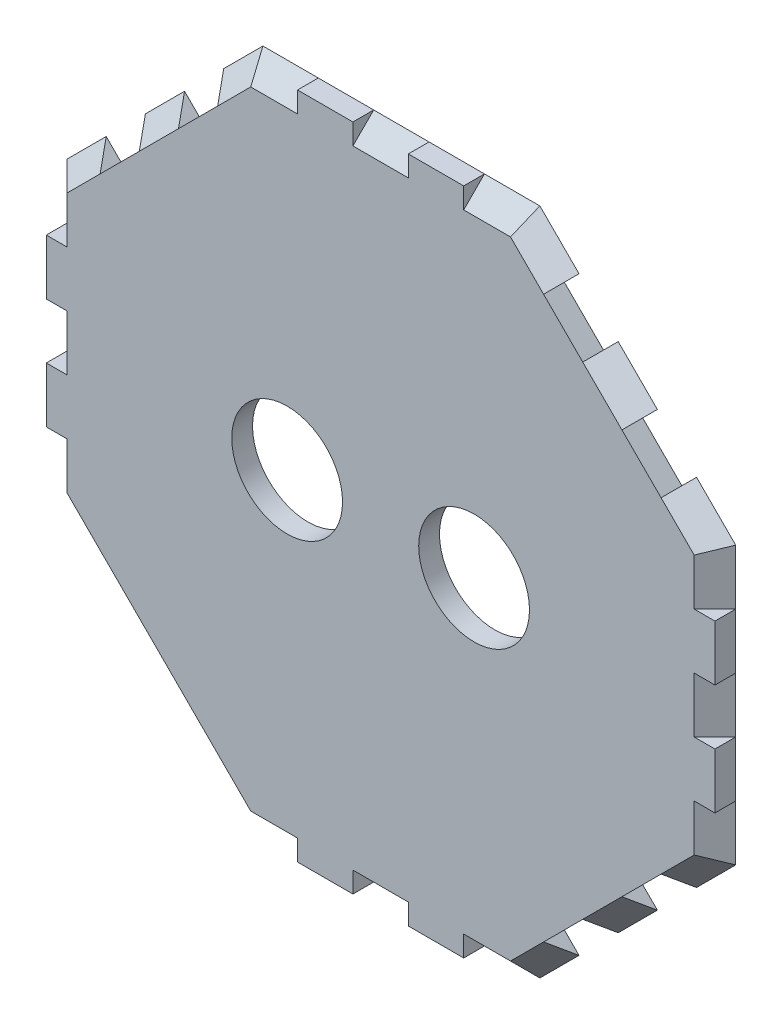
ISO-10303-21;
HEADER;
FILE_DESCRIPTION(('STEP AP214'),'2;1');
FILE_NAME('part.step','',(''),(''),'','','');
FILE_SCHEMA(('AUTOMOTIVE_DESIGN { 1 0 10303 214 1 1 1 1 }'));
ENDSEC;
DATA;
#1=APPLICATION_CONTEXT('core data for automotive mechanical design processes');
#2=APPLICATION_PROTOCOL_DEFINITION('international standard','automotive_design',2000,#1);
#3=PRODUCT_CONTEXT('',#1,'mechanical');
#4=PRODUCT('Part','Part','',(#3));
#5=PRODUCT_RELATED_PRODUCT_CATEGORY('part','',(#4));
#6=PRODUCT_DEFINITION_FORMATION('','',#4);
#7=PRODUCT_DEFINITION_CONTEXT('part definition',#1,'design');
#8=PRODUCT_DEFINITION('design','',#6,#7);
#9=PRODUCT_DEFINITION_SHAPE('','',#8);
#10=(LENGTH_UNIT() NAMED_UNIT(*) SI_UNIT(.MILLI.,.METRE.));
#11=(NAMED_UNIT(*) PLANE_ANGLE_UNIT() SI_UNIT($,.RADIAN.));
#12=(NAMED_UNIT(*) SI_UNIT($,.STERADIAN.) SOLID_ANGLE_UNIT());
#13=UNCERTAINTY_MEASURE_WITH_UNIT(LENGTH_MEASURE(1.E-05),#10,'distance_accuracy_value','');
#14=(GEOMETRIC_REPRESENTATION_CONTEXT(3) GLOBAL_UNCERTAINTY_ASSIGNED_CONTEXT((#13)) GLOBAL_UNIT_ASSIGNED_CONTEXT((#10,
#11,#12)) REPRESENTATION_CONTEXT('',''));
#15=CARTESIAN_POINT('',(0.,0.,0.));
#16=DIRECTION('',(0.,0.,1.));
#17=DIRECTION('',(1.,0.,0.));
#18=AXIS2_PLACEMENT_3D('',#15,#16,#17);
#19=CARTESIAN_POINT('',(32.0208152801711,32.0208152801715,3.));
#20=DIRECTION('',(0.499999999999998,0.500000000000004,0.707106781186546));
#21=DIRECTION('',(0.707106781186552,-0.707106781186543,0.));
#22=AXIS2_PLACEMENT_3D('',#19,#20,#21);
#23=PLANE('',#22);
#24=DIRECTION('',(0.499999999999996,0.500000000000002,-0.707106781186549));
#25=VECTOR('',#24,1.);
#26=CARTESIAN_POINT('',(40.5060966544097,23.535533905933,3.));
#27=LINE('',#26,#25);
#28=CARTESIAN_POINT('',(40.5060966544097,23.535533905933,3.));
#29=VERTEX_POINT('',#28);
#30=CARTESIAN_POINT('',(42.6274169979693,25.6568542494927,0.));
#31=VERTEX_POINT('',#30);
#32=EDGE_CURVE('E11',#29,#31,#27,.T.);
#33=ORIENTED_EDGE('',*,*,#32,.F.);
#34=DIRECTION('',(-0.707106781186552,0.707106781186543,0.));
#35=VECTOR('',#34,1.);
#36=CARTESIAN_POINT('',(17.87867965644,46.1629509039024,3.));
#37=LINE('',#36,#35);
#38=CARTESIAN_POINT('',(45.2842712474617,18.757359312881,3.));
#39=VERTEX_POINT('',#38);
#40=EDGE_CURVE('E469',#39,#29,#37,.T.);
#41=ORIENTED_EDGE('',*,*,#40,.F.);
#42=DIRECTION('',(0.678598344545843,0.281084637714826,-0.678598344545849));
#43=VECTOR('',#42,1.);
#44=CARTESIAN_POINT('',(41.7064255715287,17.2753671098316,6.57784567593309));
#45=LINE('',#44,#43);
#46=CARTESIAN_POINT('',(48.2842712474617,20.0000000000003,0.));
#47=VERTEX_POINT('',#46);
#48=EDGE_CURVE('E596',#47,#39,#45,.F.);
#49=ORIENTED_EDGE('',*,*,#48,.F.);
#50=DIRECTION('',(-0.707106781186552,0.707106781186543,0.));
#51=VECTOR('',#50,1.);
#52=CARTESIAN_POINT('',(48.2842712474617,20.0000000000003,0.));
#53=LINE('',#52,#51);
#54=EDGE_CURVE('E569',#47,#31,#53,.T.);
#55=ORIENTED_EDGE('',*,*,#54,.T.);
#56=EDGE_LOOP('',(#33,#41,#49,#55));
#57=FACE_BOUND('',#56,.T.);
#58=ADVANCED_FACE('F34',(#57),#23,.T.);
#59=DIRECTION('',(-0.499999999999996,-0.500000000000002,0.707106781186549));
#60=VECTOR('',#59,1.);
#61=CARTESIAN_POINT('',(34.8492424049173,29.1923881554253,3.));
#62=LINE('',#61,#60);
#63=CARTESIAN_POINT('',(36.9705627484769,31.313708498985,0.));
#64=VERTEX_POINT('',#63);
#65=CARTESIAN_POINT('',(34.8492424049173,29.1923881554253,3.));
#66=VERTEX_POINT('',#65);
#67=EDGE_CURVE('E42',#64,#66,#62,.T.);
#68=ORIENTED_EDGE('',*,*,#67,.F.);
#69=CARTESIAN_POINT('',(31.3137084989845,36.9705627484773,0.));
#70=VERTEX_POINT('',#69);
#71=EDGE_CURVE('E573',#64,#70,#53,.T.);
#72=ORIENTED_EDGE('',*,*,#71,.T.);
#73=DIRECTION('',(0.499999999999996,0.500000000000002,-0.707106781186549));
#74=VECTOR('',#73,1.);
#75=CARTESIAN_POINT('',(29.1923881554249,34.8492424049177,3.));
#76=LINE('',#75,#74);
#77=CARTESIAN_POINT('',(29.1923881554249,34.8492424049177,3.));
#78=VERTEX_POINT('',#77);
#79=EDGE_CURVE('E664',#78,#70,#76,.T.);
#80=ORIENTED_EDGE('',*,*,#79,.F.);
#81=EDGE_CURVE('E473',#66,#78,#37,.T.);
#82=ORIENTED_EDGE('',*,*,#81,.F.);
#83=EDGE_LOOP('',(#68,#72,#80,#82));
#84=FACE_BOUND('',#83,.T.);
#85=ADVANCED_FACE('F674',(#84),#23,.T.);
#86=CARTESIAN_POINT('',(-32.0208152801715,32.0208152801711,3.));
#87=DIRECTION('',(-0.500000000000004,0.499999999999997,0.707106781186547));
#88=DIRECTION('',(0.707106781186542,0.707106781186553,0.));
#89=AXIS2_PLACEMENT_3D('',#86,#87,#88);
#90=PLANE('',#89);
#91=DIRECTION('',(0.499999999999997,-0.500000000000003,0.707106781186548));
#92=VECTOR('',#91,1.);
#93=CARTESIAN_POINT('',(-40.5060966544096,23.5355339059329,2.99999999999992));
#94=LINE('',#93,#92);
#95=CARTESIAN_POINT('',(-42.6274169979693,25.6568542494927,0.));
#96=VERTEX_POINT('',#95);
#97=CARTESIAN_POINT('',(-40.5060966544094,23.535533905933,3.));
#98=VERTEX_POINT('',#97);
#99=EDGE_CURVE('E659',#96,#98,#94,.T.);
#100=ORIENTED_EDGE('',*,*,#99,.F.);
#101=DIRECTION('',(-0.707106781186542,-0.707106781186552,0.));
#102=VECTOR('',#101,1.);
#103=CARTESIAN_POINT('',(-20.0000000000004,48.2842712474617,0.));
#104=LINE('',#103,#102);
#105=CARTESIAN_POINT('',(-48.284271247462,19.9999999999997,0.));
#106=VERTEX_POINT('',#105);
#107=EDGE_CURVE('E550',#96,#106,#104,.T.);
#108=ORIENTED_EDGE('',*,*,#107,.T.);
#109=DIRECTION('',(0.678598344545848,-0.281084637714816,0.678598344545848));
#110=VECTOR('',#109,1.);
#111=CARTESIAN_POINT('',(-41.7064255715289,17.275367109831,6.57784567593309));
#112=LINE('',#111,#110);
#113=CARTESIAN_POINT('',(-45.284271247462,18.7573593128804,3.));
#114=VERTEX_POINT('',#113);
#115=EDGE_CURVE('E943',#114,#106,#112,.F.);
#116=ORIENTED_EDGE('',*,*,#115,.F.);
#117=DIRECTION('',(-0.707106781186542,-0.707106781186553,0.));
#118=VECTOR('',#117,1.);
#119=CARTESIAN_POINT('',(-46.1629509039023,17.87867965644,3.));
#120=LINE('',#119,#118);
#121=EDGE_CURVE('E494',#98,#114,#120,.T.);
#122=ORIENTED_EDGE('',*,*,#121,.F.);
#123=EDGE_LOOP('',(#100,#108,#116,#122));
#124=FACE_BOUND('',#123,.T.);
#125=ADVANCED_FACE('F1007',(#124),#90,.T.);
#126=DIRECTION('',(-0.499999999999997,0.500000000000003,-0.707106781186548));
#127=VECTOR('',#126,1.);
#128=CARTESIAN_POINT('',(-23.5355339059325,40.5060966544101,3.00000000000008));
#129=LINE('',#128,#127);
#130=CARTESIAN_POINT('',(-23.5355339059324,40.50609665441,3.));
#131=VERTEX_POINT('',#130);
#132=CARTESIAN_POINT('',(-25.6568542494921,42.6274169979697,0.));
#133=VERTEX_POINT('',#132);
#134=EDGE_CURVE('E655',#131,#133,#129,.T.);
#135=ORIENTED_EDGE('',*,*,#134,.F.);
#136=CARTESIAN_POINT('',(-18.757359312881,45.2842712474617,3.));
#137=VERTEX_POINT('',#136);
#138=EDGE_CURVE('E489',#137,#131,#120,.T.);
#139=ORIENTED_EDGE('',*,*,#138,.F.);
#140=DIRECTION('',(-0.281084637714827,0.678598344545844,-0.678598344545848));
#141=VECTOR('',#140,1.);
#142=CARTESIAN_POINT('',(-17.2753671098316,41.7064255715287,6.57784567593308));
#143=LINE('',#142,#141);
#144=CARTESIAN_POINT('',(-20.0000000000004,48.2842712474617,0.));
#145=VERTEX_POINT('',#144);
#146=EDGE_CURVE('E598',#137,#145,#143,.T.);
#147=ORIENTED_EDGE('',*,*,#146,.T.);
#148=EDGE_CURVE('E545',#145,#133,#104,.T.);
#149=ORIENTED_EDGE('',*,*,#148,.T.);
#150=EDGE_LOOP('',(#135,#139,#147,#149));
#151=FACE_BOUND('',#150,.T.);
#152=ADVANCED_FACE('F1001',(#151),#90,.T.);
#153=CARTESIAN_POINT('',(32.0208152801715,-32.0208152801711,3.));
#154=DIRECTION('',(0.500000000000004,-0.499999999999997,0.707106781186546));
#155=DIRECTION('',(-0.707106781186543,-0.707106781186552,0.));
#156=AXIS2_PLACEMENT_3D('',#153,#154,#155);
#157=PLANE('',#156);
#158=DIRECTION('',(-0.499999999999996,0.500000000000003,0.707106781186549));
#159=VECTOR('',#158,1.);
#160=CARTESIAN_POINT('',(40.5060966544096,-23.5355339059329,2.99999999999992));
#161=LINE('',#160,#159);
#162=CARTESIAN_POINT('',(42.6274169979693,-25.6568542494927,0.));
#163=VERTEX_POINT('',#162);
#164=CARTESIAN_POINT('',(40.5060966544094,-23.535533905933,3.));
#165=VERTEX_POINT('',#164);
#166=EDGE_CURVE('E649',#163,#165,#161,.T.);
#167=ORIENTED_EDGE('',*,*,#166,.F.);
#168=DIRECTION('',(0.707106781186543,0.707106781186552,0.));
#169=VECTOR('',#168,1.);
#170=CARTESIAN_POINT('',(20.0000000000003,-48.2842712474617,0.));
#171=LINE('',#170,#169);
#172=CARTESIAN_POINT('',(48.284271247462,-19.9999999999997,0.));
#173=VERTEX_POINT('',#172);
#174=EDGE_CURVE('E505',#163,#173,#171,.T.);
#175=ORIENTED_EDGE('',*,*,#174,.T.);
#176=DIRECTION('',(0.678598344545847,-0.281084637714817,-0.678598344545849));
#177=VECTOR('',#176,1.);
#178=CARTESIAN_POINT('',(41.7064255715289,-17.275367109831,6.57784567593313));
#179=LINE('',#178,#177);
#180=CARTESIAN_POINT('',(45.284271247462,-18.7573593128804,3.));
#181=VERTEX_POINT('',#180);
#182=EDGE_CURVE('E941',#173,#181,#179,.F.);
#183=ORIENTED_EDGE('',*,*,#182,.T.);
#184=DIRECTION('',(0.707106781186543,0.707106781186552,0.));
#185=VECTOR('',#184,1.);
#186=CARTESIAN_POINT('',(46.1629509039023,-17.87867965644,3.));
#187=LINE('',#186,#185);
#188=EDGE_CURVE('E455',#165,#181,#187,.T.);
#189=ORIENTED_EDGE('',*,*,#188,.F.);
#190=EDGE_LOOP('',(#167,#175,#183,#189));
#191=FACE_BOUND('',#190,.T.);
#192=ADVANCED_FACE('F999',(#191),#157,.T.);
#193=DIRECTION('',(0.499999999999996,-0.500000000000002,-0.707106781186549));
#194=VECTOR('',#193,1.);
#195=CARTESIAN_POINT('',(23.5355339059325,-40.5060966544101,3.00000000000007));
#196=LINE('',#195,#194);
#197=CARTESIAN_POINT('',(23.5355339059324,-40.50609665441,3.));
#198=VERTEX_POINT('',#197);
#199=CARTESIAN_POINT('',(25.6568542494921,-42.6274169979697,0.));
#200=VERTEX_POINT('',#199);
#201=EDGE_CURVE('E645',#198,#200,#196,.T.);
#202=ORIENTED_EDGE('',*,*,#201,.F.);
#203=CARTESIAN_POINT('',(18.757359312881,-45.2842712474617,3.));
#204=VERTEX_POINT('',#203);
#205=EDGE_CURVE('E450',#204,#198,#187,.T.);
#206=ORIENTED_EDGE('',*,*,#205,.F.);
#207=DIRECTION('',(0.281084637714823,-0.678598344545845,-0.678598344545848));
#208=VECTOR('',#207,1.);
#209=CARTESIAN_POINT('',(17.2753671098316,-41.7064255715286,6.57784567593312));
#210=LINE('',#209,#208);
#211=CARTESIAN_POINT('',(20.0000000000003,-48.2842712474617,0.));
#212=VERTEX_POINT('',#211);
#213=EDGE_CURVE('E945',#212,#204,#210,.F.);
#214=ORIENTED_EDGE('',*,*,#213,.F.);
#215=EDGE_CURVE('E499',#212,#200,#171,.T.);
#216=ORIENTED_EDGE('',*,*,#215,.T.);
#217=EDGE_LOOP('',(#202,#206,#214,#216));
#218=FACE_BOUND('',#217,.T.);
#219=ADVANCED_FACE('F975',(#218),#157,.T.);
#220=CARTESIAN_POINT('',(-32.0208152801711,-32.0208152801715,3.));
#221=DIRECTION('',(-0.499999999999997,-0.500000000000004,0.707106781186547));
#222=DIRECTION('',(-0.707106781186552,0.707106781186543,0.));
#223=AXIS2_PLACEMENT_3D('',#220,#221,#222);
#224=PLANE('',#223);
#225=DIRECTION('',(0.499999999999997,0.500000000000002,0.707106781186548));
#226=VECTOR('',#225,1.);
#227=CARTESIAN_POINT('',(-23.5355339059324,-40.50609665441,2.99999999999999));
#228=LINE('',#227,#226);
#229=CARTESIAN_POINT('',(-25.6568542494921,-42.6274169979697,0.));
#230=VERTEX_POINT('',#229);
#231=CARTESIAN_POINT('',(-23.5355339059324,-40.50609665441,3.));
#232=VERTEX_POINT('',#231);
#233=EDGE_CURVE('E639',#230,#232,#228,.T.);
#234=ORIENTED_EDGE('',*,*,#233,.F.);
#235=DIRECTION('',(0.707106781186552,-0.707106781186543,0.));
#236=VECTOR('',#235,1.);
#237=CARTESIAN_POINT('',(-48.2842712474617,-20.0000000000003,0.));
#238=LINE('',#237,#236);
#239=CARTESIAN_POINT('',(-19.9999999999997,-48.284271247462,0.));
#240=VERTEX_POINT('',#239);
#241=EDGE_CURVE('E530',#230,#240,#238,.T.);
#242=ORIENTED_EDGE('',*,*,#241,.T.);
#243=DIRECTION('',(-0.281084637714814,-0.678598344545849,-0.678598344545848));
#244=VECTOR('',#243,1.);
#245=CARTESIAN_POINT('',(-17.275367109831,-41.7064255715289,6.5778456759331));
#246=LINE('',#245,#244);
#247=CARTESIAN_POINT('',(-18.7573593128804,-45.284271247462,3.));
#248=VERTEX_POINT('',#247);
#249=EDGE_CURVE('E882',#240,#248,#246,.F.);
#250=ORIENTED_EDGE('',*,*,#249,.T.);
#251=DIRECTION('',(0.707106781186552,-0.707106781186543,0.));
#252=VECTOR('',#251,1.);
#253=CARTESIAN_POINT('',(-17.87867965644,-46.1629509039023,3.));
#254=LINE('',#253,#252);
#255=EDGE_CURVE('E427',#232,#248,#254,.T.);
#256=ORIENTED_EDGE('',*,*,#255,.F.);
#257=EDGE_LOOP('',(#234,#242,#250,#256));
#258=FACE_BOUND('',#257,.T.);
#259=ADVANCED_FACE('F950',(#258),#224,.T.);
#260=DIRECTION('',(-0.499999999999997,-0.500000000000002,-0.707106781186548));
#261=VECTOR('',#260,1.);
#262=CARTESIAN_POINT('',(-29.1923881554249,-34.8492424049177,3.));
#263=LINE('',#262,#261);
#264=CARTESIAN_POINT('',(-29.1923881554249,-34.8492424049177,3.));
#265=VERTEX_POINT('',#264);
#266=CARTESIAN_POINT('',(-31.3137084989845,-36.9705627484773,0.));
#267=VERTEX_POINT('',#266);
#268=EDGE_CURVE('E637',#265,#267,#263,.T.);
#269=ORIENTED_EDGE('',*,*,#268,.F.);
#270=CARTESIAN_POINT('',(-34.8492424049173,-29.1923881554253,3.));
#271=VERTEX_POINT('',#270);
#272=EDGE_CURVE('E425',#271,#265,#254,.T.);
#273=ORIENTED_EDGE('',*,*,#272,.F.);
#274=DIRECTION('',(0.499999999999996,0.500000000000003,0.707106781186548));
#275=VECTOR('',#274,1.);
#276=CARTESIAN_POINT('',(-34.8492424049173,-29.1923881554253,3.));
#277=LINE('',#276,#275);
#278=CARTESIAN_POINT('',(-36.9705627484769,-31.313708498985,0.));
#279=VERTEX_POINT('',#278);
#280=EDGE_CURVE('E416',#279,#271,#277,.T.);
#281=ORIENTED_EDGE('',*,*,#280,.F.);
#282=EDGE_CURVE('E529',#279,#267,#238,.T.);
#283=ORIENTED_EDGE('',*,*,#282,.T.);
#284=EDGE_LOOP('',(#269,#273,#281,#283));
#285=FACE_BOUND('',#284,.T.);
#286=ADVANCED_FACE('F1037',(#285),#224,.T.);
#287=CARTESIAN_POINT('',(-45.2842712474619,-3.14222753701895E-13,3.));
#288=DIRECTION('',(-0.707106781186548,0.,0.707106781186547));
#289=DIRECTION('',(0.,1.,0.));
#290=AXIS2_PLACEMENT_3D('',#287,#288,#289);
#291=PLANE('',#290);
#292=DIRECTION('',(-0.707106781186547,0.,-0.707106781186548));
#293=VECTOR('',#292,1.);
#294=CARTESIAN_POINT('',(-45.284271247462,11.9999999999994,2.99999999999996));
#295=LINE('',#294,#293);
#296=CARTESIAN_POINT('',(-45.284271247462,11.9999999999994,3.));
#297=VERTEX_POINT('',#296);
#298=CARTESIAN_POINT('',(-48.284271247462,11.9999999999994,0.));
#299=VERTEX_POINT('',#298);
#300=EDGE_CURVE('E417',#297,#299,#295,.T.);
#301=ORIENTED_EDGE('',*,*,#300,.F.);
#302=DIRECTION('',(0.,-1.,0.));
#303=VECTOR('',#302,1.);
#304=CARTESIAN_POINT('',(-45.2842712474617,-20.0000000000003,3.));
#305=LINE('',#304,#303);
#306=EDGE_CURVE('E433',#114,#297,#305,.T.);
#307=ORIENTED_EDGE('',*,*,#306,.F.);
#308=ORIENTED_EDGE('',*,*,#115,.T.);
#309=DIRECTION('',(0.,-1.,0.));
#310=VECTOR('',#309,1.);
#311=CARTESIAN_POINT('',(-48.284271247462,19.9999999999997,0.));
#312=LINE('',#311,#310);
#313=EDGE_CURVE('E533',#106,#299,#312,.T.);
#314=ORIENTED_EDGE('',*,*,#313,.T.);
#315=EDGE_LOOP('',(#301,#307,#308,#314));
#316=FACE_BOUND('',#315,.T.);
#317=ADVANCED_FACE('F1041',(#316),#291,.T.);
#318=CARTESIAN_POINT('',(45.2842712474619,3.06367184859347E-13,3.));
#319=DIRECTION('',(0.70710678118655,0.,0.707106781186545));
#320=DIRECTION('',(0.,-1.,0.));
#321=AXIS2_PLACEMENT_3D('',#318,#319,#320);
#322=PLANE('',#321);
#323=DIRECTION('',(-0.707106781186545,0.,0.70710678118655));
#324=VECTOR('',#323,1.);
#325=CARTESIAN_POINT('',(45.2842712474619,-4.,3.00000000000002));
#326=LINE('',#325,#324);
#327=CARTESIAN_POINT('',(48.284271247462,-4.,0.));
#328=VERTEX_POINT('',#327);
#329=CARTESIAN_POINT('',(45.2842712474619,-4.,3.));
#330=VERTEX_POINT('',#329);
#331=EDGE_CURVE('E629',#328,#330,#326,.T.);
#332=ORIENTED_EDGE('',*,*,#331,.F.);
#333=DIRECTION('',(0.,1.,0.));
#334=VECTOR('',#333,1.);
#335=CARTESIAN_POINT('',(48.284271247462,-19.9999999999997,0.));
#336=LINE('',#335,#334);
#337=CARTESIAN_POINT('',(48.2842712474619,4.,0.));
#338=VERTEX_POINT('',#337);
#339=EDGE_CURVE('E586',#328,#338,#336,.T.);
#340=ORIENTED_EDGE('',*,*,#339,.T.);
#341=DIRECTION('',(0.707106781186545,0.,-0.70710678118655));
#342=VECTOR('',#341,1.);
#343=CARTESIAN_POINT('',(45.2842712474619,4.,2.99999999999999));
#344=LINE('',#343,#342);
#345=CARTESIAN_POINT('',(45.2842712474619,4.,3.));
#346=VERTEX_POINT('',#345);
#347=EDGE_CURVE('E621',#346,#338,#344,.T.);
#348=ORIENTED_EDGE('',*,*,#347,.F.);
#349=DIRECTION('',(0.,1.,0.));
#350=VECTOR('',#349,1.);
#351=CARTESIAN_POINT('',(45.2842712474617,20.0000000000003,3.));
#352=LINE('',#351,#350);
#353=EDGE_CURVE('E464',#330,#346,#352,.T.);
#354=ORIENTED_EDGE('',*,*,#353,.F.);
#355=EDGE_LOOP('',(#332,#340,#348,#354));
#356=FACE_BOUND('',#355,.T.);
#357=ADVANCED_FACE('F932',(#356),#322,.T.);
#358=DIRECTION('',(-0.707106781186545,0.,0.70710678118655));
#359=VECTOR('',#358,1.);
#360=CARTESIAN_POINT('',(45.2842712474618,12.,2.99999999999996));
#361=LINE('',#360,#359);
#362=CARTESIAN_POINT('',(48.2842712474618,12.,0.));
#363=VERTEX_POINT('',#362);
#364=CARTESIAN_POINT('',(45.2842712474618,12.,3.));
#365=VERTEX_POINT('',#364);
#366=EDGE_CURVE('E624',#363,#365,#361,.T.);
#367=ORIENTED_EDGE('',*,*,#366,.F.);
#368=EDGE_CURVE('E587',#363,#47,#336,.T.);
#369=ORIENTED_EDGE('',*,*,#368,.T.);
#370=ORIENTED_EDGE('',*,*,#48,.T.);
#371=EDGE_CURVE('E465',#365,#39,#352,.T.);
#372=ORIENTED_EDGE('',*,*,#371,.F.);
#373=EDGE_LOOP('',(#367,#369,#370,#372));
#374=FACE_BOUND('',#373,.T.);
#375=ADVANCED_FACE('F919',(#374),#322,.T.);
#376=CARTESIAN_POINT('',(3.22078322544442E-13,-45.2842712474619,3.));
#377=DIRECTION('',(0.,-0.707106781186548,0.707106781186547));
#378=DIRECTION('',(-1.,0.,0.));
#379=AXIS2_PLACEMENT_3D('',#376,#377,#378);
#380=PLANE('',#379);
#381=DIRECTION('',(0.,-0.707106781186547,-0.707106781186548));
#382=VECTOR('',#381,1.);
#383=CARTESIAN_POINT('',(-11.9999999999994,-45.284271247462,2.99999999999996));
#384=LINE('',#383,#382);
#385=CARTESIAN_POINT('',(-11.9999999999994,-45.2842712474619,3.));
#386=VERTEX_POINT('',#385);
#387=CARTESIAN_POINT('',(-11.9999999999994,-48.284271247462,0.));
#388=VERTEX_POINT('',#387);
#389=EDGE_CURVE('E619',#386,#388,#384,.T.);
#390=ORIENTED_EDGE('',*,*,#389,.F.);
#391=DIRECTION('',(1.,0.,0.));
#392=VECTOR('',#391,1.);
#393=CARTESIAN_POINT('',(20.0000000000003,-45.2842712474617,3.));
#394=LINE('',#393,#392);
#395=EDGE_CURVE('E443',#248,#386,#394,.T.);
#396=ORIENTED_EDGE('',*,*,#395,.F.);
#397=ORIENTED_EDGE('',*,*,#249,.F.);
#398=DIRECTION('',(1.,0.,0.));
#399=VECTOR('',#398,1.);
#400=CARTESIAN_POINT('',(-19.9999999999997,-48.284271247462,0.));
#401=LINE('',#400,#399);
#402=EDGE_CURVE('E512',#240,#388,#401,.T.);
#403=ORIENTED_EDGE('',*,*,#402,.T.);
#404=EDGE_LOOP('',(#390,#396,#397,#403));
#405=FACE_BOUND('',#404,.T.);
#406=ADVANCED_FACE('F951',(#405),#380,.T.);
#407=DIRECTION('',(0.,0.707106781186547,0.707106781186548));
#408=VECTOR('',#407,1.);
#409=CARTESIAN_POINT('',(12.0000000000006,-45.2842712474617,3.00000000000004));
#410=LINE('',#409,#408);
#411=CARTESIAN_POINT('',(12.0000000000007,-48.2842712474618,0.));
#412=VERTEX_POINT('',#411);
#413=CARTESIAN_POINT('',(12.0000000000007,-45.2842712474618,3.));
#414=VERTEX_POINT('',#413);
#415=EDGE_CURVE('E613',#412,#414,#410,.T.);
#416=ORIENTED_EDGE('',*,*,#415,.F.);
#417=EDGE_CURVE('E520',#412,#212,#401,.T.);
#418=ORIENTED_EDGE('',*,*,#417,.T.);
#419=ORIENTED_EDGE('',*,*,#213,.T.);
#420=EDGE_CURVE('E445',#414,#204,#394,.T.);
#421=ORIENTED_EDGE('',*,*,#420,.F.);
#422=EDGE_LOOP('',(#416,#418,#419,#421));
#423=FACE_BOUND('',#422,.T.);
#424=ADVANCED_FACE('F974',(#423),#380,.T.);
#425=DIRECTION('',(0.707106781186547,0.,0.707106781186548));
#426=VECTOR('',#425,1.);
#427=CARTESIAN_POINT('',(-45.2842712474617,-12.0000000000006,3.00000000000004));
#428=LINE('',#427,#426);
#429=CARTESIAN_POINT('',(-48.2842712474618,-12.0000000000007,0.));
#430=VERTEX_POINT('',#429);
#431=CARTESIAN_POINT('',(-45.2842712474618,-12.0000000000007,3.));
#432=VERTEX_POINT('',#431);
#433=EDGE_CURVE('E607',#430,#432,#428,.T.);
#434=ORIENTED_EDGE('',*,*,#433,.F.);
#435=CARTESIAN_POINT('',(-48.2842712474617,-20.0000000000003,0.));
#436=VERTEX_POINT('',#435);
#437=EDGE_CURVE('E539',#430,#436,#312,.T.);
#438=ORIENTED_EDGE('',*,*,#437,.T.);
#439=DIRECTION('',(0.678598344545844,0.281084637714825,0.678598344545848));
#440=VECTOR('',#439,1.);
#441=CARTESIAN_POINT('',(-41.7064255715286,-17.2753671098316,6.57784567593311));
#442=LINE('',#441,#440);
#443=CARTESIAN_POINT('',(-45.2842712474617,-18.757359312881,3.));
#444=VERTEX_POINT('',#443);
#445=EDGE_CURVE('E949',#444,#436,#442,.F.);
#446=ORIENTED_EDGE('',*,*,#445,.F.);
#447=EDGE_CURVE('E422',#432,#444,#305,.T.);
#448=ORIENTED_EDGE('',*,*,#447,.F.);
#449=EDGE_LOOP('',(#434,#438,#446,#448));
#450=FACE_BOUND('',#449,.T.);
#451=ADVANCED_FACE('F1042',(#450),#291,.T.);
#452=CARTESIAN_POINT('',(-3.22078322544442E-13,45.2842712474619,3.));
#453=DIRECTION('',(0.,0.707106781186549,0.707106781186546));
#454=DIRECTION('',(1.,0.,0.));
#455=AXIS2_PLACEMENT_3D('',#452,#453,#454);
#456=PLANE('',#455);
#457=DIRECTION('',(0.,-0.707106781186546,0.707106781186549));
#458=VECTOR('',#457,1.);
#459=CARTESIAN_POINT('',(4.,45.2842712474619,3.00000000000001));
#460=LINE('',#459,#458);
#461=CARTESIAN_POINT('',(4.,48.284271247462,0.));
#462=VERTEX_POINT('',#461);
#463=CARTESIAN_POINT('',(4.,45.2842712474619,3.));
#464=VERTEX_POINT('',#463);
#465=EDGE_CURVE('E864',#462,#464,#460,.T.);
#466=ORIENTED_EDGE('',*,*,#465,.F.);
#467=DIRECTION('',(-1.,0.,0.));
#468=VECTOR('',#467,1.);
#469=CARTESIAN_POINT('',(19.9999999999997,48.284271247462,0.));
#470=LINE('',#469,#468);
#471=CARTESIAN_POINT('',(-4.,48.2842712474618,0.));
#472=VERTEX_POINT('',#471);
#473=EDGE_CURVE('E562',#462,#472,#470,.T.);
#474=ORIENTED_EDGE('',*,*,#473,.T.);
#475=DIRECTION('',(0.,0.707106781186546,-0.707106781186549));
#476=VECTOR('',#475,1.);
#477=CARTESIAN_POINT('',(-4.,45.2842712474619,2.99999999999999));
#478=LINE('',#477,#476);
#479=CARTESIAN_POINT('',(-4.,45.2842712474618,3.));
#480=VERTEX_POINT('',#479);
#481=EDGE_CURVE('E429',#480,#472,#478,.T.);
#482=ORIENTED_EDGE('',*,*,#481,.F.);
#483=DIRECTION('',(-1.,0.,0.));
#484=VECTOR('',#483,1.);
#485=CARTESIAN_POINT('',(-20.0000000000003,45.2842712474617,3.));
#486=LINE('',#485,#484);
#487=EDGE_CURVE('E483',#464,#480,#486,.T.);
#488=ORIENTED_EDGE('',*,*,#487,.F.);
#489=EDGE_LOOP('',(#466,#474,#482,#488));
#490=FACE_BOUND('',#489,.T.);
#491=ADVANCED_FACE('F899',(#490),#456,.T.);
#492=DIRECTION('',(0.,0.707106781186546,-0.707106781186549));
#493=VECTOR('',#492,1.);
#494=CARTESIAN_POINT('',(12.,45.2842712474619,3.00000000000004));
#495=LINE('',#494,#493);
#496=CARTESIAN_POINT('',(12.,45.284271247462,3.));
#497=VERTEX_POINT('',#496);
#498=CARTESIAN_POINT('',(12.,48.284271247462,0.));
#499=VERTEX_POINT('',#498);
#500=EDGE_CURVE('E860',#497,#499,#495,.T.);
#501=ORIENTED_EDGE('',*,*,#500,.F.);
#502=CARTESIAN_POINT('',(18.7573593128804,45.284271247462,3.));
#503=VERTEX_POINT('',#502);
#504=EDGE_CURVE('E478',#503,#497,#486,.T.);
#505=ORIENTED_EDGE('',*,*,#504,.F.);
#506=DIRECTION('',(0.281084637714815,0.678598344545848,-0.678598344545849));
#507=VECTOR('',#506,1.);
#508=CARTESIAN_POINT('',(17.275367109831,41.7064255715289,6.5778456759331));
#509=LINE('',#508,#507);
#510=CARTESIAN_POINT('',(19.9999999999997,48.284271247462,0.));
#511=VERTEX_POINT('',#510);
#512=EDGE_CURVE('E592',#503,#511,#509,.T.);
#513=ORIENTED_EDGE('',*,*,#512,.T.);
#514=EDGE_CURVE('E557',#511,#499,#470,.T.);
#515=ORIENTED_EDGE('',*,*,#514,.T.);
#516=EDGE_LOOP('',(#501,#505,#513,#515));
#517=FACE_BOUND('',#516,.T.);
#518=ADVANCED_FACE('F1023',(#517),#456,.T.);
#519=CARTESIAN_POINT('',(0.,0.,3.));
#520=DIRECTION('',(0.,0.,1.));
#521=DIRECTION('',(1.,0.,0.));
#522=AXIS2_PLACEMENT_3D('',#519,#520,#521);
#523=PLANE('',#522);
#524=CARTESIAN_POINT('',(-13.5,0.,3.));
#525=DIRECTION('',(0.,0.,1.));
#526=DIRECTION('',(1.,0.,0.));
#527=AXIS2_PLACEMENT_3D('',#524,#525,#526);
#528=CIRCLE('',#527,8.);
#529=CARTESIAN_POINT('',(-5.5,0.,3.));
#530=VERTEX_POINT('',#529);
#531=EDGE_CURVE('E1098',#530,#530,#528,.T.);
#532=ORIENTED_EDGE('',*,*,#531,.F.);
#533=EDGE_LOOP('',(#532));
#534=FACE_BOUND('',#533,.T.);
#535=CARTESIAN_POINT('',(13.5,0.,3.));
#536=DIRECTION('',(0.,0.,1.));
#537=DIRECTION('',(1.,0.,0.));
#538=AXIS2_PLACEMENT_3D('',#535,#536,#537);
#539=CIRCLE('',#538,8.);
#540=CARTESIAN_POINT('',(21.5,0.,3.));
#541=VERTEX_POINT('',#540);
#542=EDGE_CURVE('E1481',#541,#541,#539,.T.);
#543=ORIENTED_EDGE('',*,*,#542,.F.);
#544=EDGE_LOOP('',(#543));
#545=FACE_BOUND('',#544,.T.);
#546=ORIENTED_EDGE('',*,*,#306,.T.);
#547=DIRECTION('',(1.,0.,0.));
#548=VECTOR('',#547,1.);
#549=CARTESIAN_POINT('',(-45.2842712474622,11.9999999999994,3.));
#550=LINE('',#549,#548);
#551=CARTESIAN_POINT('',(-48.284271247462,11.9999999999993,3.));
#552=VERTEX_POINT('',#551);
#553=EDGE_CURVE('E745',#552,#297,#550,.T.);
#554=ORIENTED_EDGE('',*,*,#553,.F.);
#555=DIRECTION('',(0.,1.,0.));
#556=VECTOR('',#555,1.);
#557=CARTESIAN_POINT('',(-48.284271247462,11.9999999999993,3.));
#558=LINE('',#557,#556);
#559=CARTESIAN_POINT('',(-48.2842712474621,3.99999999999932,3.));
#560=VERTEX_POINT('',#559);
#561=EDGE_CURVE('E750',#560,#552,#558,.T.);
#562=ORIENTED_EDGE('',*,*,#561,.F.);
#563=DIRECTION('',(-1.,0.,0.));
#564=VECTOR('',#563,1.);
#565=CARTESIAN_POINT('',(-48.2842712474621,3.99999999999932,3.));
#566=LINE('',#565,#564);
#567=CARTESIAN_POINT('',(-45.2842712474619,3.99999999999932,3.));
#568=VERTEX_POINT('',#567);
#569=EDGE_CURVE('E747',#568,#560,#566,.T.);
#570=ORIENTED_EDGE('',*,*,#569,.F.);
#571=CARTESIAN_POINT('',(-45.2842712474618,-4.00000000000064,3.));
#572=VERTEX_POINT('',#571);
#573=EDGE_CURVE('E438',#568,#572,#305,.T.);
#574=ORIENTED_EDGE('',*,*,#573,.T.);
#575=DIRECTION('',(1.,0.,0.));
#576=VECTOR('',#575,1.);
#577=CARTESIAN_POINT('',(-48.284271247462,-4.00000000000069,3.));
#578=LINE('',#577,#576);
#579=CARTESIAN_POINT('',(-48.284271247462,-4.00000000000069,3.));
#580=VERTEX_POINT('',#579);
#581=EDGE_CURVE('E835',#580,#572,#578,.T.);
#582=ORIENTED_EDGE('',*,*,#581,.F.);
#583=DIRECTION('',(0.,1.,0.));
#584=VECTOR('',#583,1.);
#585=CARTESIAN_POINT('',(-48.2842712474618,-12.0000000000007,3.));
#586=LINE('',#585,#584);
#587=CARTESIAN_POINT('',(-48.2842712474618,-12.0000000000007,3.));
#588=VERTEX_POINT('',#587);
#589=EDGE_CURVE('E832',#588,#580,#586,.T.);
#590=ORIENTED_EDGE('',*,*,#589,.F.);
#591=DIRECTION('',(-1.,0.,0.));
#592=VECTOR('',#591,1.);
#593=CARTESIAN_POINT('',(-45.2842712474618,-12.0000000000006,3.));
#594=LINE('',#593,#592);
#595=EDGE_CURVE('E829',#432,#588,#594,.T.);
#596=ORIENTED_EDGE('',*,*,#595,.F.);
#597=ORIENTED_EDGE('',*,*,#447,.T.);
#598=CARTESIAN_POINT('',(-40.5060966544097,-23.535533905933,3.));
#599=VERTEX_POINT('',#598);
#600=EDGE_CURVE('E413',#444,#599,#254,.T.);
#601=ORIENTED_EDGE('',*,*,#600,.T.);
#602=DIRECTION('',(0.707106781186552,-0.707106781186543,0.));
#603=VECTOR('',#602,1.);
#604=CARTESIAN_POINT('',(-34.8492424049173,-29.1923881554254,3.));
#605=LINE('',#604,#603);
#606=EDGE_CURVE('E398',#599,#271,#605,.T.);
#607=ORIENTED_EDGE('',*,*,#606,.T.);
#608=ORIENTED_EDGE('',*,*,#272,.T.);
#609=DIRECTION('',(0.707106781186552,-0.707106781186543,0.));
#610=VECTOR('',#609,1.);
#611=CARTESIAN_POINT('',(-29.1923881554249,-34.8492424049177,3.));
#612=LINE('',#611,#610);
#613=EDGE_CURVE('E720',#265,#232,#612,.T.);
#614=ORIENTED_EDGE('',*,*,#613,.T.);
#615=ORIENTED_EDGE('',*,*,#255,.T.);
#616=ORIENTED_EDGE('',*,*,#395,.T.);
#617=DIRECTION('',(0.,1.,0.));
#618=VECTOR('',#617,1.);
#619=CARTESIAN_POINT('',(-11.9999999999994,-45.2842712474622,3.));
#620=LINE('',#619,#618);
#621=CARTESIAN_POINT('',(-11.9999999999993,-48.284271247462,3.));
#622=VERTEX_POINT('',#621);
#623=EDGE_CURVE('E795',#622,#386,#620,.T.);
#624=ORIENTED_EDGE('',*,*,#623,.F.);
#625=DIRECTION('',(-1.,0.,0.));
#626=VECTOR('',#625,1.);
#627=CARTESIAN_POINT('',(-11.9999999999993,-48.284271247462,3.));
#628=LINE('',#627,#626);
#629=CARTESIAN_POINT('',(-3.99999999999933,-48.2842712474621,3.));
#630=VERTEX_POINT('',#629);
#631=EDGE_CURVE('E800',#630,#622,#628,.T.);
#632=ORIENTED_EDGE('',*,*,#631,.F.);
#633=DIRECTION('',(0.,-1.,0.));
#634=VECTOR('',#633,1.);
#635=CARTESIAN_POINT('',(-3.99999999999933,-48.2842712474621,3.));
#636=LINE('',#635,#634);
#637=CARTESIAN_POINT('',(-3.99999999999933,-45.2842712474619,3.));
#638=VERTEX_POINT('',#637);
#639=EDGE_CURVE('E797',#638,#630,#636,.T.);
#640=ORIENTED_EDGE('',*,*,#639,.F.);
#641=CARTESIAN_POINT('',(4.00000000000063,-45.2842712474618,3.));
#642=VERTEX_POINT('',#641);
#643=EDGE_CURVE('E444',#638,#642,#394,.T.);
#644=ORIENTED_EDGE('',*,*,#643,.T.);
#645=DIRECTION('',(0.,1.,0.));
#646=VECTOR('',#645,1.);
#647=CARTESIAN_POINT('',(4.00000000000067,-48.284271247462,3.));
#648=LINE('',#647,#646);
#649=CARTESIAN_POINT('',(4.00000000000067,-48.284271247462,3.));
#650=VERTEX_POINT('',#649);
#651=EDGE_CURVE('E817',#650,#642,#648,.T.);
#652=ORIENTED_EDGE('',*,*,#651,.F.);
#653=DIRECTION('',(-1.,0.,0.));
#654=VECTOR('',#653,1.);
#655=CARTESIAN_POINT('',(12.0000000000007,-48.2842712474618,3.));
#656=LINE('',#655,#654);
#657=CARTESIAN_POINT('',(12.0000000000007,-48.2842712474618,3.));
#658=VERTEX_POINT('',#657);
#659=EDGE_CURVE('E814',#658,#650,#656,.T.);
#660=ORIENTED_EDGE('',*,*,#659,.F.);
#661=DIRECTION('',(0.,-1.,0.));
#662=VECTOR('',#661,1.);
#663=CARTESIAN_POINT('',(12.0000000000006,-45.2842712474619,3.));
#664=LINE('',#663,#662);
#665=EDGE_CURVE('E811',#414,#658,#664,.T.);
#666=ORIENTED_EDGE('',*,*,#665,.F.);
#667=ORIENTED_EDGE('',*,*,#420,.T.);
#668=ORIENTED_EDGE('',*,*,#205,.T.);
#669=DIRECTION('',(0.707106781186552,0.707106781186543,0.));
#670=VECTOR('',#669,1.);
#671=CARTESIAN_POINT('',(29.1923881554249,-34.8492424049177,3.));
#672=LINE('',#671,#670);
#673=CARTESIAN_POINT('',(29.1923881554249,-34.8492424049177,3.));
#674=VERTEX_POINT('',#673);
#675=EDGE_CURVE('E706',#198,#674,#672,.T.);
#676=ORIENTED_EDGE('',*,*,#675,.T.);
#677=CARTESIAN_POINT('',(34.8492424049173,-29.1923881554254,3.));
#678=VERTEX_POINT('',#677);
#679=EDGE_CURVE('E454',#674,#678,#187,.T.);
#680=ORIENTED_EDGE('',*,*,#679,.T.);
#681=DIRECTION('',(0.707106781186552,0.707106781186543,0.));
#682=VECTOR('',#681,1.);
#683=CARTESIAN_POINT('',(34.8492424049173,-29.1923881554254,3.));
#684=LINE('',#683,#682);
#685=EDGE_CURVE('E692',#678,#165,#684,.T.);
#686=ORIENTED_EDGE('',*,*,#685,.T.);
#687=ORIENTED_EDGE('',*,*,#188,.T.);
#688=CARTESIAN_POINT('',(45.284271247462,-12.,3.));
#689=VERTEX_POINT('',#688);
#690=EDGE_CURVE('E459',#181,#689,#352,.T.);
#691=ORIENTED_EDGE('',*,*,#690,.T.);
#692=DIRECTION('',(-1.,0.,0.));
#693=VECTOR('',#692,1.);
#694=CARTESIAN_POINT('',(45.284271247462,-12.,3.));
#695=LINE('',#694,#693);
#696=CARTESIAN_POINT('',(48.284271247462,-12.,3.));
#697=VERTEX_POINT('',#696);
#698=EDGE_CURVE('E764',#697,#689,#695,.T.);
#699=ORIENTED_EDGE('',*,*,#698,.F.);
#700=DIRECTION('',(0.,-1.,0.));
#701=VECTOR('',#700,1.);
#702=CARTESIAN_POINT('',(48.284271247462,-12.,3.));
#703=LINE('',#702,#701);
#704=CARTESIAN_POINT('',(48.284271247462,-4.,3.));
#705=VERTEX_POINT('',#704);
#706=EDGE_CURVE('E761',#705,#697,#703,.T.);
#707=ORIENTED_EDGE('',*,*,#706,.F.);
#708=DIRECTION('',(1.,0.,0.));
#709=VECTOR('',#708,1.);
#710=CARTESIAN_POINT('',(48.284271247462,-4.,3.));
#711=LINE('',#710,#709);
#712=EDGE_CURVE('E766',#330,#705,#711,.T.);
#713=ORIENTED_EDGE('',*,*,#712,.F.);
#714=ORIENTED_EDGE('',*,*,#353,.T.);
#715=DIRECTION('',(-1.,0.,0.));
#716=VECTOR('',#715,1.);
#717=CARTESIAN_POINT('',(48.284271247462,4.,3.));
#718=LINE('',#717,#716);
#719=CARTESIAN_POINT('',(48.284271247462,4.,3.));
#720=VERTEX_POINT('',#719);
#721=EDGE_CURVE('E780',#720,#346,#718,.T.);
#722=ORIENTED_EDGE('',*,*,#721,.F.);
#723=DIRECTION('',(0.,-1.,0.));
#724=VECTOR('',#723,1.);
#725=CARTESIAN_POINT('',(48.2842712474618,12.,3.));
#726=LINE('',#725,#724);
#727=CARTESIAN_POINT('',(48.2842712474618,12.,3.));
#728=VERTEX_POINT('',#727);
#729=EDGE_CURVE('E777',#728,#720,#726,.T.);
#730=ORIENTED_EDGE('',*,*,#729,.F.);
#731=DIRECTION('',(1.,0.,0.));
#732=VECTOR('',#731,1.);
#733=CARTESIAN_POINT('',(45.284271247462,12.,3.));
#734=LINE('',#733,#732);
#735=EDGE_CURVE('E783',#365,#728,#734,.T.);
#736=ORIENTED_EDGE('',*,*,#735,.F.);
#737=ORIENTED_EDGE('',*,*,#371,.T.);
#738=ORIENTED_EDGE('',*,*,#40,.T.);
#739=DIRECTION('',(-0.707106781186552,0.707106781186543,0.));
#740=VECTOR('',#739,1.);
#741=CARTESIAN_POINT('',(34.8492424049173,29.1923881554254,3.));
#742=LINE('',#741,#740);
#743=EDGE_CURVE('E675',#29,#66,#742,.T.);
#744=ORIENTED_EDGE('',*,*,#743,.T.);
#745=ORIENTED_EDGE('',*,*,#81,.T.);
#746=DIRECTION('',(-0.707106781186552,0.707106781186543,0.));
#747=VECTOR('',#746,1.);
#748=CARTESIAN_POINT('',(29.1923881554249,34.8492424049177,3.));
#749=LINE('',#748,#747);
#750=CARTESIAN_POINT('',(23.5355339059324,40.50609665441,3.));
#751=VERTEX_POINT('',#750);
#752=EDGE_CURVE('E733',#78,#751,#749,.T.);
#753=ORIENTED_EDGE('',*,*,#752,.T.);
#754=EDGE_CURVE('E474',#751,#503,#37,.T.);
#755=ORIENTED_EDGE('',*,*,#754,.T.);
#756=ORIENTED_EDGE('',*,*,#504,.T.);
#757=DIRECTION('',(0.,-1.,0.));
#758=VECTOR('',#757,1.);
#759=CARTESIAN_POINT('',(12.,45.284271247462,3.));
#760=LINE('',#759,#758);
#761=CARTESIAN_POINT('',(12.,48.284271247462,3.));
#762=VERTEX_POINT('',#761);
#763=EDGE_CURVE('E850',#762,#497,#760,.T.);
#764=ORIENTED_EDGE('',*,*,#763,.F.);
#765=DIRECTION('',(1.,0.,0.));
#766=VECTOR('',#765,1.);
#767=CARTESIAN_POINT('',(12.,48.284271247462,3.));
#768=LINE('',#767,#766);
#769=CARTESIAN_POINT('',(4.,48.284271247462,3.));
#770=VERTEX_POINT('',#769);
#771=EDGE_CURVE('E847',#770,#762,#768,.T.);
#772=ORIENTED_EDGE('',*,*,#771,.F.);
#773=DIRECTION('',(0.,1.,0.));
#774=VECTOR('',#773,1.);
#775=CARTESIAN_POINT('',(4.,48.284271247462,3.));
#776=LINE('',#775,#774);
#777=EDGE_CURVE('E852',#464,#770,#776,.T.);
#778=ORIENTED_EDGE('',*,*,#777,.F.);
#779=ORIENTED_EDGE('',*,*,#487,.T.);
#780=DIRECTION('',(0.,-1.,0.));
#781=VECTOR('',#780,1.);
#782=CARTESIAN_POINT('',(-4.,48.284271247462,3.));
#783=LINE('',#782,#781);
#784=CARTESIAN_POINT('',(-4.,48.284271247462,3.));
#785=VERTEX_POINT('',#784);
#786=EDGE_CURVE('E874',#785,#480,#783,.T.);
#787=ORIENTED_EDGE('',*,*,#786,.F.);
#788=DIRECTION('',(1.,0.,0.));
#789=VECTOR('',#788,1.);
#790=CARTESIAN_POINT('',(-12.,48.2842712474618,3.));
#791=LINE('',#790,#789);
#792=CARTESIAN_POINT('',(-12.,48.2842712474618,3.));
#793=VERTEX_POINT('',#792);
#794=EDGE_CURVE('E871',#793,#785,#791,.T.);
#795=ORIENTED_EDGE('',*,*,#794,.F.);
#796=DIRECTION('',(0.,1.,0.));
#797=VECTOR('',#796,1.);
#798=CARTESIAN_POINT('',(-12.,45.284271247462,3.));
#799=LINE('',#798,#797);
#800=CARTESIAN_POINT('',(-12.,45.2842712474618,3.));
#801=VERTEX_POINT('',#800);
#802=EDGE_CURVE('E868',#801,#793,#799,.T.);
#803=ORIENTED_EDGE('',*,*,#802,.F.);
#804=EDGE_CURVE('E484',#801,#137,#486,.T.);
#805=ORIENTED_EDGE('',*,*,#804,.T.);
#806=ORIENTED_EDGE('',*,*,#138,.T.);
#807=DIRECTION('',(-0.707106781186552,-0.707106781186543,0.));
#808=VECTOR('',#807,1.);
#809=CARTESIAN_POINT('',(-29.1923881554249,34.8492424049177,3.));
#810=LINE('',#809,#808);
#811=CARTESIAN_POINT('',(-29.1923881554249,34.8492424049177,3.));
#812=VERTEX_POINT('',#811);
#813=EDGE_CURVE('E1091',#131,#812,#810,.T.);
#814=ORIENTED_EDGE('',*,*,#813,.T.);
#815=CARTESIAN_POINT('',(-34.8492424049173,29.1923881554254,3.));
#816=VERTEX_POINT('',#815);
#817=EDGE_CURVE('E493',#812,#816,#120,.T.);
#818=ORIENTED_EDGE('',*,*,#817,.T.);
#819=DIRECTION('',(-0.707106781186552,-0.707106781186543,0.));
#820=VECTOR('',#819,1.);
#821=CARTESIAN_POINT('',(-34.8492424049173,29.1923881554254,3.));
#822=LINE('',#821,#820);
#823=EDGE_CURVE('E1071',#816,#98,#822,.T.);
#824=ORIENTED_EDGE('',*,*,#823,.T.);
#825=ORIENTED_EDGE('',*,*,#121,.T.);
#826=EDGE_LOOP('',(#546,#554,#562,#570,#574,#582,#590,#596,#597,#601,#607,#608,#614,#615,#616,
#624,#632,#640,#644,#652,#660,#666,#667,#668,#676,#680,#686,#687,#691,#699,#707,#713,#714,#722,
#730,#736,#737,#738,#744,#745,#753,#755,#756,#764,#772,#778,#779,#787,#795,#803,#805,#806,#814,
#818,#824,#825));
#827=FACE_BOUND('',#826,.T.);
#828=ADVANCED_FACE('F420',(#534,#545,#827),#523,.T.);
#829=CARTESIAN_POINT('',(0.,0.,0.));
#830=DIRECTION('',(0.,0.,1.));
#831=DIRECTION('',(1.,0.,0.));
#832=AXIS2_PLACEMENT_3D('',#829,#830,#831);
#833=PLANE('',#832);
#834=CARTESIAN_POINT('',(-13.5,0.,0.));
#835=DIRECTION('',(0.,0.,-1.));
#836=DIRECTION('',(-1.,0.,0.));
#837=AXIS2_PLACEMENT_3D('',#834,#835,#836);
#838=CIRCLE('',#837,8.);
#839=CARTESIAN_POINT('',(-21.5,0.,0.));
#840=VERTEX_POINT('',#839);
#841=EDGE_CURVE('E1480',#840,#840,#838,.T.);
#842=ORIENTED_EDGE('',*,*,#841,.F.);
#843=EDGE_LOOP('',(#842));
#844=FACE_BOUND('',#843,.T.);
#845=CARTESIAN_POINT('',(13.5,0.,0.));
#846=DIRECTION('',(0.,0.,-1.));
#847=DIRECTION('',(-1.,0.,0.));
#848=AXIS2_PLACEMENT_3D('',#845,#846,#847);
#849=CIRCLE('',#848,8.);
#850=CARTESIAN_POINT('',(5.5,0.,0.));
#851=VERTEX_POINT('',#850);
#852=EDGE_CURVE('E1482',#851,#851,#849,.T.);
#853=ORIENTED_EDGE('',*,*,#852,.F.);
#854=EDGE_LOOP('',(#853));
#855=FACE_BOUND('',#854,.T.);
#856=DIRECTION('',(-0.707106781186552,0.707106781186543,0.));
#857=VECTOR('',#856,1.);
#858=CARTESIAN_POINT('',(34.8492424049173,29.1923881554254,0.));
#859=LINE('',#858,#857);
#860=CARTESIAN_POINT('',(40.5060966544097,23.535533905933,0.));
#861=VERTEX_POINT('',#860);
#862=CARTESIAN_POINT('',(34.8492424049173,29.1923881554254,0.));
#863=VERTEX_POINT('',#862);
#864=EDGE_CURVE('E686',#861,#863,#859,.T.);
#865=ORIENTED_EDGE('',*,*,#864,.F.);
#866=DIRECTION('',(-0.707106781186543,-0.707106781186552,0.));
#867=VECTOR('',#866,1.);
#868=CARTESIAN_POINT('',(40.5060966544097,23.535533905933,0.));
#869=LINE('',#868,#867);
#870=EDGE_CURVE('E676',#31,#861,#869,.T.);
#871=ORIENTED_EDGE('',*,*,#870,.F.);
#872=ORIENTED_EDGE('',*,*,#54,.F.);
#873=ORIENTED_EDGE('',*,*,#368,.F.);
#874=DIRECTION('',(0.,-1.,0.));
#875=VECTOR('',#874,1.);
#876=CARTESIAN_POINT('',(48.2842712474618,12.,0.));
#877=LINE('',#876,#875);
#878=EDGE_CURVE('E774',#363,#338,#877,.T.);
#879=ORIENTED_EDGE('',*,*,#878,.T.);
#880=ORIENTED_EDGE('',*,*,#339,.F.);
#881=DIRECTION('',(0.,-1.,0.));
#882=VECTOR('',#881,1.);
#883=CARTESIAN_POINT('',(48.284271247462,-12.,0.));
#884=LINE('',#883,#882);
#885=CARTESIAN_POINT('',(48.284271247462,-12.,0.));
#886=VERTEX_POINT('',#885);
#887=EDGE_CURVE('E758',#328,#886,#884,.T.);
#888=ORIENTED_EDGE('',*,*,#887,.T.);
#889=EDGE_CURVE('E581',#173,#886,#336,.T.);
#890=ORIENTED_EDGE('',*,*,#889,.F.);
#891=ORIENTED_EDGE('',*,*,#174,.F.);
#892=DIRECTION('',(0.707106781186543,-0.707106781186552,0.));
#893=VECTOR('',#892,1.);
#894=CARTESIAN_POINT('',(40.5060966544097,-23.535533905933,0.));
#895=LINE('',#894,#893);
#896=CARTESIAN_POINT('',(40.5060966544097,-23.535533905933,0.));
#897=VERTEX_POINT('',#896);
#898=EDGE_CURVE('E696',#897,#163,#895,.T.);
#899=ORIENTED_EDGE('',*,*,#898,.F.);
#900=DIRECTION('',(0.707106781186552,0.707106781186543,0.));
#901=VECTOR('',#900,1.);
#902=CARTESIAN_POINT('',(34.8492424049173,-29.1923881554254,0.));
#903=LINE('',#902,#901);
#904=CARTESIAN_POINT('',(34.8492424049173,-29.1923881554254,0.));
#905=VERTEX_POINT('',#904);
#906=EDGE_CURVE('E695',#905,#897,#903,.T.);
#907=ORIENTED_EDGE('',*,*,#906,.F.);
#908=DIRECTION('',(-0.707106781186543,0.707106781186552,0.));
#909=VECTOR('',#908,1.);
#910=CARTESIAN_POINT('',(36.9705627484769,-31.313708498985,0.));
#911=LINE('',#910,#909);
#912=CARTESIAN_POINT('',(36.9705627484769,-31.313708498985,0.));
#913=VERTEX_POINT('',#912);
#914=EDGE_CURVE('E698',#913,#905,#911,.T.);
#915=ORIENTED_EDGE('',*,*,#914,.F.);
#916=CARTESIAN_POINT('',(31.3137084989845,-36.9705627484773,0.));
#917=VERTEX_POINT('',#916);
#918=EDGE_CURVE('E504',#917,#913,#171,.T.);
#919=ORIENTED_EDGE('',*,*,#918,.F.);
#920=DIRECTION('',(0.707106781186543,-0.707106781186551,0.));
#921=VECTOR('',#920,1.);
#922=CARTESIAN_POINT('',(31.3137084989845,-36.9705627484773,0.));
#923=LINE('',#922,#921);
#924=CARTESIAN_POINT('',(29.1923881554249,-34.8492424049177,0.));
#925=VERTEX_POINT('',#924);
#926=EDGE_CURVE('E709',#925,#917,#923,.T.);
#927=ORIENTED_EDGE('',*,*,#926,.F.);
#928=DIRECTION('',(0.707106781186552,0.707106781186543,0.));
#929=VECTOR('',#928,1.);
#930=CARTESIAN_POINT('',(29.1923881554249,-34.8492424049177,0.));
#931=LINE('',#930,#929);
#932=CARTESIAN_POINT('',(23.5355339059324,-40.50609665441,0.));
#933=VERTEX_POINT('',#932);
#934=EDGE_CURVE('E713',#933,#925,#931,.T.);
#935=ORIENTED_EDGE('',*,*,#934,.F.);
#936=DIRECTION('',(-0.707106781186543,0.707106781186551,0.));
#937=VECTOR('',#936,1.);
#938=CARTESIAN_POINT('',(23.5355339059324,-40.50609665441,0.));
#939=LINE('',#938,#937);
#940=EDGE_CURVE('E710',#200,#933,#939,.T.);
#941=ORIENTED_EDGE('',*,*,#940,.F.);
#942=ORIENTED_EDGE('',*,*,#215,.F.);
#943=ORIENTED_EDGE('',*,*,#417,.F.);
#944=DIRECTION('',(-1.,0.,0.));
#945=VECTOR('',#944,1.);
#946=CARTESIAN_POINT('',(12.0000000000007,-48.2842712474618,0.));
#947=LINE('',#946,#945);
#948=CARTESIAN_POINT('',(4.00000000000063,-48.2842712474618,0.));
#949=VERTEX_POINT('',#948);
#950=EDGE_CURVE('E808',#412,#949,#947,.T.);
#951=ORIENTED_EDGE('',*,*,#950,.T.);
#952=CARTESIAN_POINT('',(-3.99999999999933,-48.2842712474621,0.));
#953=VERTEX_POINT('',#952);
#954=EDGE_CURVE('E519',#953,#949,#401,.T.);
#955=ORIENTED_EDGE('',*,*,#954,.F.);
#956=DIRECTION('',(-1.,0.,0.));
#957=VECTOR('',#956,1.);
#958=CARTESIAN_POINT('',(-11.9999999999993,-48.284271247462,0.));
#959=LINE('',#958,#957);
#960=EDGE_CURVE('E792',#953,#388,#959,.T.);
#961=ORIENTED_EDGE('',*,*,#960,.T.);
#962=ORIENTED_EDGE('',*,*,#402,.F.);
#963=ORIENTED_EDGE('',*,*,#241,.F.);
#964=DIRECTION('',(-0.707106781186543,-0.707106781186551,0.));
#965=VECTOR('',#964,1.);
#966=CARTESIAN_POINT('',(-23.5355339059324,-40.50609665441,0.));
#967=LINE('',#966,#965);
#968=CARTESIAN_POINT('',(-23.5355339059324,-40.50609665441,0.));
#969=VERTEX_POINT('',#968);
#970=EDGE_CURVE('E723',#969,#230,#967,.T.);
#971=ORIENTED_EDGE('',*,*,#970,.F.);
#972=DIRECTION('',(0.707106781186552,-0.707106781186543,0.));
#973=VECTOR('',#972,1.);
#974=CARTESIAN_POINT('',(-29.1923881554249,-34.8492424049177,0.));
#975=LINE('',#974,#973);
#976=CARTESIAN_POINT('',(-29.1923881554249,-34.8492424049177,0.));
#977=VERTEX_POINT('',#976);
#978=EDGE_CURVE('E727',#977,#969,#975,.T.);
#979=ORIENTED_EDGE('',*,*,#978,.F.);
#980=DIRECTION('',(0.707106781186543,0.707106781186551,0.));
#981=VECTOR('',#980,1.);
#982=CARTESIAN_POINT('',(-31.3137084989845,-36.9705627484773,0.));
#983=LINE('',#982,#981);
#984=EDGE_CURVE('E724',#267,#977,#983,.T.);
#985=ORIENTED_EDGE('',*,*,#984,.F.);
#986=ORIENTED_EDGE('',*,*,#282,.F.);
#987=DIRECTION('',(-0.707106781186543,-0.707106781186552,0.));
#988=VECTOR('',#987,1.);
#989=CARTESIAN_POINT('',(-36.9705627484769,-31.313708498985,0.));
#990=LINE('',#989,#988);
#991=CARTESIAN_POINT('',(-34.8492424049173,-29.1923881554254,0.));
#992=VERTEX_POINT('',#991);
#993=EDGE_CURVE('E406',#992,#279,#990,.T.);
#994=ORIENTED_EDGE('',*,*,#993,.F.);
#995=DIRECTION('',(0.707106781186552,-0.707106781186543,0.));
#996=VECTOR('',#995,1.);
#997=CARTESIAN_POINT('',(-34.8492424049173,-29.1923881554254,0.));
#998=LINE('',#997,#996);
#999=CARTESIAN_POINT('',(-40.5060966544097,-23.535533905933,0.));
#1000=VERTEX_POINT('',#999);
#1001=EDGE_CURVE('E1491',#1000,#992,#998,.T.);
#1002=ORIENTED_EDGE('',*,*,#1001,.F.);
#1003=DIRECTION('',(0.707106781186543,0.707106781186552,0.));
#1004=VECTOR('',#1003,1.);
#1005=CARTESIAN_POINT('',(-40.5060966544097,-23.535533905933,0.));
#1006=LINE('',#1005,#1004);
#1007=CARTESIAN_POINT('',(-42.6274169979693,-25.6568542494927,0.));
#1008=VERTEX_POINT('',#1007);
#1009=EDGE_CURVE('E393',#1008,#1000,#1006,.T.);
#1010=ORIENTED_EDGE('',*,*,#1009,.F.);
#1011=EDGE_CURVE('E415',#436,#1008,#238,.T.);
#1012=ORIENTED_EDGE('',*,*,#1011,.F.);
#1013=ORIENTED_EDGE('',*,*,#437,.F.);
#1014=DIRECTION('',(0.,1.,0.));
#1015=VECTOR('',#1014,1.);
#1016=CARTESIAN_POINT('',(-48.2842712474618,-12.0000000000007,0.));
#1017=LINE('',#1016,#1015);
#1018=CARTESIAN_POINT('',(-48.2842712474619,-4.00000000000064,0.));
#1019=VERTEX_POINT('',#1018);
#1020=EDGE_CURVE('E826',#430,#1019,#1017,.T.);
#1021=ORIENTED_EDGE('',*,*,#1020,.T.);
#1022=CARTESIAN_POINT('',(-48.2842712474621,3.99999999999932,0.));
#1023=VERTEX_POINT('',#1022);
#1024=EDGE_CURVE('E538',#1023,#1019,#312,.T.);
#1025=ORIENTED_EDGE('',*,*,#1024,.F.);
#1026=DIRECTION('',(0.,1.,0.));
#1027=VECTOR('',#1026,1.);
#1028=CARTESIAN_POINT('',(-48.284271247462,11.9999999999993,0.));
#1029=LINE('',#1028,#1027);
#1030=EDGE_CURVE('E743',#1023,#299,#1029,.T.);
#1031=ORIENTED_EDGE('',*,*,#1030,.T.);
#1032=ORIENTED_EDGE('',*,*,#313,.F.);
#1033=ORIENTED_EDGE('',*,*,#107,.F.);
#1034=DIRECTION('',(-0.707106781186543,0.707106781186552,0.));
#1035=VECTOR('',#1034,1.);
#1036=CARTESIAN_POINT('',(-40.5060966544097,23.535533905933,0.));
#1037=LINE('',#1036,#1035);
#1038=CARTESIAN_POINT('',(-40.5060966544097,23.535533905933,0.));
#1039=VERTEX_POINT('',#1038);
#1040=EDGE_CURVE('E1085',#1039,#96,#1037,.T.);
#1041=ORIENTED_EDGE('',*,*,#1040,.F.);
#1042=DIRECTION('',(-0.707106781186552,-0.707106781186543,0.));
#1043=VECTOR('',#1042,1.);
#1044=CARTESIAN_POINT('',(-34.8492424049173,29.1923881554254,0.));
#1045=LINE('',#1044,#1043);
#1046=CARTESIAN_POINT('',(-34.8492424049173,29.1923881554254,0.));
#1047=VERTEX_POINT('',#1046);
#1048=EDGE_CURVE('E1076',#1047,#1039,#1045,.T.);
#1049=ORIENTED_EDGE('',*,*,#1048,.F.);
#1050=DIRECTION('',(0.707106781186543,-0.707106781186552,0.));
#1051=VECTOR('',#1050,1.);
#1052=CARTESIAN_POINT('',(-36.9705627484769,31.313708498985,0.));
#1053=LINE('',#1052,#1051);
#1054=CARTESIAN_POINT('',(-36.9705627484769,31.313708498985,0.));
#1055=VERTEX_POINT('',#1054);
#1056=EDGE_CURVE('E1081',#1055,#1047,#1053,.T.);
#1057=ORIENTED_EDGE('',*,*,#1056,.F.);
#1058=CARTESIAN_POINT('',(-31.3137084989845,36.9705627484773,0.));
#1059=VERTEX_POINT('',#1058);
#1060=EDGE_CURVE('E549',#1059,#1055,#104,.T.);
#1061=ORIENTED_EDGE('',*,*,#1060,.F.);
#1062=DIRECTION('',(-0.707106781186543,0.707106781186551,0.));
#1063=VECTOR('',#1062,1.);
#1064=CARTESIAN_POINT('',(-31.3137084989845,36.9705627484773,0.));
#1065=LINE('',#1064,#1063);
#1066=CARTESIAN_POINT('',(-29.1923881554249,34.8492424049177,0.));
#1067=VERTEX_POINT('',#1066);
#1068=EDGE_CURVE('E1093',#1067,#1059,#1065,.T.);
#1069=ORIENTED_EDGE('',*,*,#1068,.F.);
#1070=DIRECTION('',(-0.707106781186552,-0.707106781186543,0.));
#1071=VECTOR('',#1070,1.);
#1072=CARTESIAN_POINT('',(-29.1923881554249,34.8492424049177,0.));
#1073=LINE('',#1072,#1071);
#1074=CARTESIAN_POINT('',(-23.5355339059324,40.50609665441,0.));
#1075=VERTEX_POINT('',#1074);
#1076=EDGE_CURVE('E1097',#1075,#1067,#1073,.T.);
#1077=ORIENTED_EDGE('',*,*,#1076,.F.);
#1078=DIRECTION('',(0.707106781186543,-0.707106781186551,0.));
#1079=VECTOR('',#1078,1.);
#1080=CARTESIAN_POINT('',(-23.5355339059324,40.50609665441,0.));
#1081=LINE('',#1080,#1079);
#1082=EDGE_CURVE('E1094',#133,#1075,#1081,.T.);
#1083=ORIENTED_EDGE('',*,*,#1082,.F.);
#1084=ORIENTED_EDGE('',*,*,#148,.F.);
#1085=CARTESIAN_POINT('',(-12.,48.2842712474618,0.));
#1086=VERTEX_POINT('',#1085);
#1087=EDGE_CURVE('E563',#1086,#145,#470,.T.);
#1088=ORIENTED_EDGE('',*,*,#1087,.F.);
#1089=DIRECTION('',(1.,0.,0.));
#1090=VECTOR('',#1089,1.);
#1091=CARTESIAN_POINT('',(-12.,48.2842712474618,0.));
#1092=LINE('',#1091,#1090);
#1093=EDGE_CURVE('E867',#1086,#472,#1092,.T.);
#1094=ORIENTED_EDGE('',*,*,#1093,.T.);
#1095=ORIENTED_EDGE('',*,*,#473,.F.);
#1096=DIRECTION('',(1.,0.,0.));
#1097=VECTOR('',#1096,1.);
#1098=CARTESIAN_POINT('',(12.,48.284271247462,0.));
#1099=LINE('',#1098,#1097);
#1100=EDGE_CURVE('E844',#462,#499,#1099,.T.);
#1101=ORIENTED_EDGE('',*,*,#1100,.T.);
#1102=ORIENTED_EDGE('',*,*,#514,.F.);
#1103=CARTESIAN_POINT('',(25.6568542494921,42.6274169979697,0.));
#1104=VERTEX_POINT('',#1103);
#1105=EDGE_CURVE('E574',#1104,#511,#53,.T.);
#1106=ORIENTED_EDGE('',*,*,#1105,.F.);
#1107=DIRECTION('',(0.707106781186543,0.707106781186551,0.));
#1108=VECTOR('',#1107,1.);
#1109=CARTESIAN_POINT('',(23.5355339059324,40.50609665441,0.));
#1110=LINE('',#1109,#1108);
#1111=CARTESIAN_POINT('',(23.5355339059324,40.50609665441,0.));
#1112=VERTEX_POINT('',#1111);
#1113=EDGE_CURVE('E737',#1112,#1104,#1110,.T.);
#1114=ORIENTED_EDGE('',*,*,#1113,.F.);
#1115=DIRECTION('',(-0.707106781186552,0.707106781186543,0.));
#1116=VECTOR('',#1115,1.);
#1117=CARTESIAN_POINT('',(29.1923881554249,34.8492424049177,0.));
#1118=LINE('',#1117,#1116);
#1119=CARTESIAN_POINT('',(29.1923881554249,34.8492424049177,0.));
#1120=VERTEX_POINT('',#1119);
#1121=EDGE_CURVE('E690',#1120,#1112,#1118,.T.);
#1122=ORIENTED_EDGE('',*,*,#1121,.F.);
#1123=DIRECTION('',(-0.707106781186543,-0.707106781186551,0.));
#1124=VECTOR('',#1123,1.);
#1125=CARTESIAN_POINT('',(31.3137084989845,36.9705627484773,0.));
#1126=LINE('',#1125,#1124);
#1127=EDGE_CURVE('E735',#70,#1120,#1126,.T.);
#1128=ORIENTED_EDGE('',*,*,#1127,.F.);
#1129=ORIENTED_EDGE('',*,*,#71,.F.);
#1130=DIRECTION('',(0.707106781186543,0.707106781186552,0.));
#1131=VECTOR('',#1130,1.);
#1132=CARTESIAN_POINT('',(36.9705627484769,31.313708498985,0.));
#1133=LINE('',#1132,#1131);
#1134=EDGE_CURVE('E670',#863,#64,#1133,.T.);
#1135=ORIENTED_EDGE('',*,*,#1134,.F.);
#1136=EDGE_LOOP('',(#865,#871,#872,#873,#879,#880,#888,#890,#891,#899,#907,#915,#919,#927,#935,
#941,#942,#943,#951,#955,#961,#962,#963,#971,#979,#985,#986,#994,#1002,#1010,#1012,#1013,#1021,
#1025,#1031,#1032,#1033,#1041,#1049,#1057,#1061,#1069,#1077,#1083,#1084,#1088,#1094,#1095,#1101,
#1102,#1106,#1114,#1122,#1128,#1129,#1135));
#1137=FACE_BOUND('',#1136,.T.);
#1138=ADVANCED_FACE('F892',(#844,#855,#1137),#833,.F.);
#1139=DIRECTION('',(-0.499999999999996,-0.500000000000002,0.707106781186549));
#1140=VECTOR('',#1139,1.);
#1141=CARTESIAN_POINT('',(23.5355339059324,40.50609665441,2.99999999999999));
#1142=LINE('',#1141,#1140);
#1143=EDGE_CURVE('E662',#1104,#751,#1142,.T.);
#1144=ORIENTED_EDGE('',*,*,#1143,.F.);
#1145=ORIENTED_EDGE('',*,*,#1105,.T.);
#1146=ORIENTED_EDGE('',*,*,#512,.F.);
#1147=ORIENTED_EDGE('',*,*,#754,.F.);
#1148=EDGE_LOOP('',(#1144,#1145,#1146,#1147));
#1149=FACE_BOUND('',#1148,.T.);
#1150=ADVANCED_FACE('F36',(#1149),#23,.T.);
#1151=DIRECTION('',(0.,-0.707106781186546,0.707106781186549));
#1152=VECTOR('',#1151,1.);
#1153=CARTESIAN_POINT('',(-12.,45.2842712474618,2.99999999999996));
#1154=LINE('',#1153,#1152);
#1155=EDGE_CURVE('E424',#1086,#801,#1154,.T.);
#1156=ORIENTED_EDGE('',*,*,#1155,.F.);
#1157=ORIENTED_EDGE('',*,*,#1087,.T.);
#1158=ORIENTED_EDGE('',*,*,#146,.F.);
#1159=ORIENTED_EDGE('',*,*,#804,.F.);
#1160=EDGE_LOOP('',(#1156,#1157,#1158,#1159));
#1161=FACE_BOUND('',#1160,.T.);
#1162=ADVANCED_FACE('F1018',(#1161),#456,.T.);
#1163=DIRECTION('',(0.707106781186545,0.,-0.70710678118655));
#1164=VECTOR('',#1163,1.);
#1165=CARTESIAN_POINT('',(45.2842712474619,-12.,3.00000000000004));
#1166=LINE('',#1165,#1164);
#1167=EDGE_CURVE('E627',#689,#886,#1166,.T.);
#1168=ORIENTED_EDGE('',*,*,#1167,.F.);
#1169=ORIENTED_EDGE('',*,*,#690,.F.);
#1170=ORIENTED_EDGE('',*,*,#182,.F.);
#1171=ORIENTED_EDGE('',*,*,#889,.T.);
#1172=EDGE_LOOP('',(#1168,#1169,#1170,#1171));
#1173=FACE_BOUND('',#1172,.T.);
#1174=ADVANCED_FACE('F942',(#1173),#322,.T.);
#1175=DIRECTION('',(-0.499999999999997,0.500000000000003,-0.707106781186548));
#1176=VECTOR('',#1175,1.);
#1177=CARTESIAN_POINT('',(-34.8492424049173,29.1923881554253,2.99999999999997));
#1178=LINE('',#1177,#1176);
#1179=EDGE_CURVE('E657',#816,#1055,#1178,.T.);
#1180=ORIENTED_EDGE('',*,*,#1179,.F.);
#1181=ORIENTED_EDGE('',*,*,#817,.F.);
#1182=DIRECTION('',(0.499999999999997,-0.500000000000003,0.707106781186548));
#1183=VECTOR('',#1182,1.);
#1184=CARTESIAN_POINT('',(-29.1923881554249,34.8492424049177,3.00000000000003));
#1185=LINE('',#1184,#1183);
#1186=EDGE_CURVE('E652',#1059,#812,#1185,.T.);
#1187=ORIENTED_EDGE('',*,*,#1186,.F.);
#1188=ORIENTED_EDGE('',*,*,#1060,.T.);
#1189=EDGE_LOOP('',(#1180,#1181,#1187,#1188));
#1190=FACE_BOUND('',#1189,.T.);
#1191=ADVANCED_FACE('F1009',(#1190),#90,.T.);
#1192=DIRECTION('',(0.499999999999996,-0.500000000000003,-0.707106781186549));
#1193=VECTOR('',#1192,1.);
#1194=CARTESIAN_POINT('',(34.8492424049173,-29.1923881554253,2.99999999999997));
#1195=LINE('',#1194,#1193);
#1196=EDGE_CURVE('E647',#678,#913,#1195,.T.);
#1197=ORIENTED_EDGE('',*,*,#1196,.F.);
#1198=ORIENTED_EDGE('',*,*,#679,.F.);
#1199=DIRECTION('',(-0.499999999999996,0.500000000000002,0.707106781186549));
#1200=VECTOR('',#1199,1.);
#1201=CARTESIAN_POINT('',(29.1923881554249,-34.8492424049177,3.00000000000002));
#1202=LINE('',#1201,#1200);
#1203=EDGE_CURVE('E642',#917,#674,#1202,.T.);
#1204=ORIENTED_EDGE('',*,*,#1203,.F.);
#1205=ORIENTED_EDGE('',*,*,#918,.T.);
#1206=EDGE_LOOP('',(#1197,#1198,#1204,#1205));
#1207=FACE_BOUND('',#1206,.T.);
#1208=ADVANCED_FACE('F990',(#1207),#157,.T.);
#1209=DIRECTION('',(0.707106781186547,0.,0.707106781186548));
#1210=VECTOR('',#1209,1.);
#1211=CARTESIAN_POINT('',(-45.2842712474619,3.99999999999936,2.99999999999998));
#1212=LINE('',#1211,#1210);
#1213=EDGE_CURVE('E632',#1023,#568,#1212,.T.);
#1214=ORIENTED_EDGE('',*,*,#1213,.F.);
#1215=ORIENTED_EDGE('',*,*,#1024,.T.);
#1216=DIRECTION('',(-0.707106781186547,0.,-0.707106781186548));
#1217=VECTOR('',#1216,1.);
#1218=CARTESIAN_POINT('',(-45.2842712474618,-4.00000000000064,3.00000000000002));
#1219=LINE('',#1218,#1217);
#1220=EDGE_CURVE('E604',#572,#1019,#1219,.T.);
#1221=ORIENTED_EDGE('',*,*,#1220,.F.);
#1222=ORIENTED_EDGE('',*,*,#573,.F.);
#1223=EDGE_LOOP('',(#1214,#1215,#1221,#1222));
#1224=FACE_BOUND('',#1223,.T.);
#1225=ADVANCED_FACE('F1012',(#1224),#291,.T.);
#1226=DIRECTION('',(0.,0.707106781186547,0.707106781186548));
#1227=VECTOR('',#1226,1.);
#1228=CARTESIAN_POINT('',(-3.99999999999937,-45.2842712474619,2.99999999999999));
#1229=LINE('',#1228,#1227);
#1230=EDGE_CURVE('E616',#953,#638,#1229,.T.);
#1231=ORIENTED_EDGE('',*,*,#1230,.F.);
#1232=ORIENTED_EDGE('',*,*,#954,.T.);
#1233=DIRECTION('',(0.,-0.707106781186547,-0.707106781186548));
#1234=VECTOR('',#1233,1.);
#1235=CARTESIAN_POINT('',(4.00000000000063,-45.2842712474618,3.00000000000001));
#1236=LINE('',#1235,#1234);
#1237=EDGE_CURVE('E610',#642,#949,#1236,.T.);
#1238=ORIENTED_EDGE('',*,*,#1237,.F.);
#1239=ORIENTED_EDGE('',*,*,#643,.F.);
#1240=EDGE_LOOP('',(#1231,#1232,#1238,#1239));
#1241=FACE_BOUND('',#1240,.T.);
#1242=ADVANCED_FACE('F965',(#1241),#380,.T.);
#1243=DIRECTION('',(-0.499999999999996,-0.500000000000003,-0.707106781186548));
#1244=VECTOR('',#1243,1.);
#1245=CARTESIAN_POINT('',(-40.5060966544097,-23.535533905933,3.));
#1246=LINE('',#1245,#1244);
#1247=EDGE_CURVE('E391',#599,#1008,#1246,.T.);
#1248=ORIENTED_EDGE('',*,*,#1247,.F.);
#1249=ORIENTED_EDGE('',*,*,#600,.F.);
#1250=ORIENTED_EDGE('',*,*,#445,.T.);
#1251=ORIENTED_EDGE('',*,*,#1011,.T.);
#1252=EDGE_LOOP('',(#1248,#1249,#1250,#1251));
#1253=FACE_BOUND('',#1252,.T.);
#1254=ADVANCED_FACE('F411',(#1253),#224,.T.);
#1255=CARTESIAN_POINT('',(-4.,48.284271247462,3.));
#1256=DIRECTION('',(1.,0.,0.));
#1257=DIRECTION('',(0.,0.,-1.));
#1258=AXIS2_PLACEMENT_3D('',#1255,#1256,#1257);
#1259=PLANE('',#1258);
#1260=ORIENTED_EDGE('',*,*,#786,.T.);
#1261=ORIENTED_EDGE('',*,*,#481,.T.);
#1262=DIRECTION('',(0.,0.,-1.));
#1263=VECTOR('',#1262,1.);
#1264=CARTESIAN_POINT('',(-4.,48.284271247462,3.));
#1265=LINE('',#1264,#1263);
#1266=EDGE_CURVE('E880',#785,#472,#1265,.T.);
#1267=ORIENTED_EDGE('',*,*,#1266,.F.);
#1268=EDGE_LOOP('',(#1260,#1261,#1267));
#1269=FACE_BOUND('',#1268,.T.);
#1270=ADVANCED_FACE('F896',(#1269),#1259,.T.);
#1271=CARTESIAN_POINT('',(-12.,48.2842712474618,3.));
#1272=DIRECTION('',(0.,1.,0.));
#1273=DIRECTION('',(-1.,0.,0.));
#1274=AXIS2_PLACEMENT_3D('',#1271,#1272,#1273);
#1275=PLANE('',#1274);
#1276=ORIENTED_EDGE('',*,*,#1093,.F.);
#1277=DIRECTION('',(0.,0.,-1.));
#1278=VECTOR('',#1277,1.);
#1279=CARTESIAN_POINT('',(-12.,48.2842712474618,3.));
#1280=LINE('',#1279,#1278);
#1281=EDGE_CURVE('E877',#793,#1086,#1280,.T.);
#1282=ORIENTED_EDGE('',*,*,#1281,.F.);
#1283=ORIENTED_EDGE('',*,*,#794,.T.);
#1284=ORIENTED_EDGE('',*,*,#1266,.T.);
#1285=EDGE_LOOP('',(#1276,#1282,#1283,#1284));
#1286=FACE_BOUND('',#1285,.T.);
#1287=ADVANCED_FACE('F889',(#1286),#1275,.T.);
#1288=CARTESIAN_POINT('',(-12.,45.284271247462,3.));
#1289=DIRECTION('',(-1.,0.,0.));
#1290=DIRECTION('',(0.,0.,1.));
#1291=AXIS2_PLACEMENT_3D('',#1288,#1289,#1290);
#1292=PLANE('',#1291);
#1293=ORIENTED_EDGE('',*,*,#1281,.T.);
#1294=ORIENTED_EDGE('',*,*,#1155,.T.);
#1295=ORIENTED_EDGE('',*,*,#802,.T.);
#1296=EDGE_LOOP('',(#1293,#1294,#1295));
#1297=FACE_BOUND('',#1296,.T.);
#1298=ADVANCED_FACE('F886',(#1297),#1292,.T.);
#1299=CARTESIAN_POINT('',(12.,48.284271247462,3.));
#1300=DIRECTION('',(0.,1.,0.));
#1301=DIRECTION('',(-1.,0.,0.));
#1302=AXIS2_PLACEMENT_3D('',#1299,#1300,#1301);
#1303=PLANE('',#1302);
#1304=ORIENTED_EDGE('',*,*,#1100,.F.);
#1305=DIRECTION('',(0.,0.,-1.));
#1306=VECTOR('',#1305,1.);
#1307=CARTESIAN_POINT('',(4.,48.284271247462,3.));
#1308=LINE('',#1307,#1306);
#1309=EDGE_CURVE('E857',#770,#462,#1308,.T.);
#1310=ORIENTED_EDGE('',*,*,#1309,.F.);
#1311=ORIENTED_EDGE('',*,*,#771,.T.);
#1312=DIRECTION('',(0.,0.,-1.));
#1313=VECTOR('',#1312,1.);
#1314=CARTESIAN_POINT('',(12.,48.284271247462,3.));
#1315=LINE('',#1314,#1313);
#1316=EDGE_CURVE('E855',#762,#499,#1315,.T.);
#1317=ORIENTED_EDGE('',*,*,#1316,.T.);
#1318=EDGE_LOOP('',(#1304,#1310,#1311,#1317));
#1319=FACE_BOUND('',#1318,.T.);
#1320=ADVANCED_FACE('F906',(#1319),#1303,.T.);
#1321=CARTESIAN_POINT('',(4.,48.284271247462,3.));
#1322=DIRECTION('',(-1.,0.,0.));
#1323=DIRECTION('',(0.,0.,1.));
#1324=AXIS2_PLACEMENT_3D('',#1321,#1322,#1323);
#1325=PLANE('',#1324);
#1326=ORIENTED_EDGE('',*,*,#1309,.T.);
#1327=ORIENTED_EDGE('',*,*,#465,.T.);
#1328=ORIENTED_EDGE('',*,*,#777,.T.);
#1329=EDGE_LOOP('',(#1326,#1327,#1328));
#1330=FACE_BOUND('',#1329,.T.);
#1331=ADVANCED_FACE('F903',(#1330),#1325,.T.);
#1332=CARTESIAN_POINT('',(12.,45.284271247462,3.));
#1333=DIRECTION('',(1.,0.,0.));
#1334=DIRECTION('',(0.,0.,-1.));
#1335=AXIS2_PLACEMENT_3D('',#1332,#1333,#1334);
#1336=PLANE('',#1335);
#1337=ORIENTED_EDGE('',*,*,#763,.T.);
#1338=ORIENTED_EDGE('',*,*,#500,.T.);
#1339=ORIENTED_EDGE('',*,*,#1316,.F.);
#1340=EDGE_LOOP('',(#1337,#1338,#1339));
#1341=FACE_BOUND('',#1340,.T.);
#1342=ADVANCED_FACE('F1215',(#1341),#1336,.T.);
#1343=CARTESIAN_POINT('',(-45.2842712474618,-12.0000000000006,3.));
#1344=DIRECTION('',(0.,-1.,0.));
#1345=DIRECTION('',(1.,0.,0.));
#1346=AXIS2_PLACEMENT_3D('',#1343,#1344,#1345);
#1347=PLANE('',#1346);
#1348=DIRECTION('',(0.,0.,-1.));
#1349=VECTOR('',#1348,1.);
#1350=CARTESIAN_POINT('',(-48.2842712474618,-12.0000000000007,3.));
#1351=LINE('',#1350,#1349);
#1352=EDGE_CURVE('E838',#588,#430,#1351,.T.);
#1353=ORIENTED_EDGE('',*,*,#1352,.T.);
#1354=ORIENTED_EDGE('',*,*,#433,.T.);
#1355=ORIENTED_EDGE('',*,*,#595,.T.);
#1356=EDGE_LOOP('',(#1353,#1354,#1355));
#1357=FACE_BOUND('',#1356,.T.);
#1358=ADVANCED_FACE('F1054',(#1357),#1347,.T.);
#1359=CARTESIAN_POINT('',(-48.284271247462,-4.00000000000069,3.));
#1360=DIRECTION('',(0.,1.,0.));
#1361=DIRECTION('',(-1.,0.,0.));
#1362=AXIS2_PLACEMENT_3D('',#1359,#1360,#1361);
#1363=PLANE('',#1362);
#1364=ORIENTED_EDGE('',*,*,#581,.T.);
#1365=ORIENTED_EDGE('',*,*,#1220,.T.);
#1366=DIRECTION('',(0.,0.,-1.));
#1367=VECTOR('',#1366,1.);
#1368=CARTESIAN_POINT('',(-48.284271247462,-4.00000000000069,3.));
#1369=LINE('',#1368,#1367);
#1370=EDGE_CURVE('E841',#580,#1019,#1369,.T.);
#1371=ORIENTED_EDGE('',*,*,#1370,.F.);
#1372=EDGE_LOOP('',(#1364,#1365,#1371));
#1373=FACE_BOUND('',#1372,.T.);
#1374=ADVANCED_FACE('F1060',(#1373),#1363,.T.);
#1375=CARTESIAN_POINT('',(-48.2842712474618,-12.0000000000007,3.));
#1376=DIRECTION('',(-1.,0.,0.));
#1377=DIRECTION('',(0.,-1.,0.));
#1378=AXIS2_PLACEMENT_3D('',#1375,#1376,#1377);
#1379=PLANE('',#1378);
#1380=ORIENTED_EDGE('',*,*,#1020,.F.);
#1381=ORIENTED_EDGE('',*,*,#1352,.F.);
#1382=ORIENTED_EDGE('',*,*,#589,.T.);
#1383=ORIENTED_EDGE('',*,*,#1370,.T.);
#1384=EDGE_LOOP('',(#1380,#1381,#1382,#1383));
#1385=FACE_BOUND('',#1384,.T.);
#1386=ADVANCED_FACE('F1057',(#1385),#1379,.T.);
#1387=CARTESIAN_POINT('',(12.0000000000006,-45.2842712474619,3.));
#1388=DIRECTION('',(1.,0.,0.));
#1389=DIRECTION('',(0.,1.,0.));
#1390=AXIS2_PLACEMENT_3D('',#1387,#1388,#1389);
#1391=PLANE('',#1390);
#1392=DIRECTION('',(0.,0.,-1.));
#1393=VECTOR('',#1392,1.);
#1394=CARTESIAN_POINT('',(12.0000000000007,-48.2842712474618,3.));
#1395=LINE('',#1394,#1393);
#1396=EDGE_CURVE('E820',#658,#412,#1395,.T.);
#1397=ORIENTED_EDGE('',*,*,#1396,.T.);
#1398=ORIENTED_EDGE('',*,*,#415,.T.);
#1399=ORIENTED_EDGE('',*,*,#665,.T.);
#1400=EDGE_LOOP('',(#1397,#1398,#1399));
#1401=FACE_BOUND('',#1400,.T.);
#1402=ADVANCED_FACE('F973',(#1401),#1391,.T.);
#1403=CARTESIAN_POINT('',(4.00000000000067,-48.284271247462,3.));
#1404=DIRECTION('',(-1.,0.,0.));
#1405=DIRECTION('',(0.,-1.,0.));
#1406=AXIS2_PLACEMENT_3D('',#1403,#1404,#1405);
#1407=PLANE('',#1406);
#1408=ORIENTED_EDGE('',*,*,#651,.T.);
#1409=ORIENTED_EDGE('',*,*,#1237,.T.);
#1410=DIRECTION('',(0.,0.,-1.));
#1411=VECTOR('',#1410,1.);
#1412=CARTESIAN_POINT('',(4.00000000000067,-48.284271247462,3.));
#1413=LINE('',#1412,#1411);
#1414=EDGE_CURVE('E823',#650,#949,#1413,.T.);
#1415=ORIENTED_EDGE('',*,*,#1414,.F.);
#1416=EDGE_LOOP('',(#1408,#1409,#1415));
#1417=FACE_BOUND('',#1416,.T.);
#1418=ADVANCED_FACE('F967',(#1417),#1407,.T.);
#1419=CARTESIAN_POINT('',(12.0000000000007,-48.2842712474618,3.));
#1420=DIRECTION('',(0.,-1.,0.));
#1421=DIRECTION('',(1.,0.,0.));
#1422=AXIS2_PLACEMENT_3D('',#1419,#1420,#1421);
#1423=PLANE('',#1422);
#1424=ORIENTED_EDGE('',*,*,#950,.F.);
#1425=ORIENTED_EDGE('',*,*,#1396,.F.);
#1426=ORIENTED_EDGE('',*,*,#659,.T.);
#1427=ORIENTED_EDGE('',*,*,#1414,.T.);
#1428=EDGE_LOOP('',(#1424,#1425,#1426,#1427));
#1429=FACE_BOUND('',#1428,.T.);
#1430=ADVANCED_FACE('F971',(#1429),#1423,.T.);
#1431=CARTESIAN_POINT('',(-11.9999999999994,-45.2842712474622,3.));
#1432=DIRECTION('',(-1.,0.,0.));
#1433=DIRECTION('',(0.,-1.,0.));
#1434=AXIS2_PLACEMENT_3D('',#1431,#1432,#1433);
#1435=PLANE('',#1434);
#1436=ORIENTED_EDGE('',*,*,#623,.T.);
#1437=ORIENTED_EDGE('',*,*,#389,.T.);
#1438=DIRECTION('',(0.,0.,-1.));
#1439=VECTOR('',#1438,1.);
#1440=CARTESIAN_POINT('',(-11.9999999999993,-48.284271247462,3.));
#1441=LINE('',#1440,#1439);
#1442=EDGE_CURVE('E805',#622,#388,#1441,.T.);
#1443=ORIENTED_EDGE('',*,*,#1442,.F.);
#1444=EDGE_LOOP('',(#1436,#1437,#1443));
#1445=FACE_BOUND('',#1444,.T.);
#1446=ADVANCED_FACE('F953',(#1445),#1435,.T.);
#1447=CARTESIAN_POINT('',(-11.9999999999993,-48.284271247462,3.));
#1448=DIRECTION('',(0.,-1.,0.));
#1449=DIRECTION('',(1.,0.,0.));
#1450=AXIS2_PLACEMENT_3D('',#1447,#1448,#1449);
#1451=PLANE('',#1450);
#1452=ORIENTED_EDGE('',*,*,#960,.F.);
#1453=DIRECTION('',(0.,0.,-1.));
#1454=VECTOR('',#1453,1.);
#1455=CARTESIAN_POINT('',(-3.99999999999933,-48.2842712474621,3.));
#1456=LINE('',#1455,#1454);
#1457=EDGE_CURVE('E803',#630,#953,#1456,.T.);
#1458=ORIENTED_EDGE('',*,*,#1457,.F.);
#1459=ORIENTED_EDGE('',*,*,#631,.T.);
#1460=ORIENTED_EDGE('',*,*,#1442,.T.);
#1461=EDGE_LOOP('',(#1452,#1458,#1459,#1460));
#1462=FACE_BOUND('',#1461,.T.);
#1463=ADVANCED_FACE('F956',(#1462),#1451,.T.);
#1464=CARTESIAN_POINT('',(-3.99999999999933,-48.2842712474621,3.));
#1465=DIRECTION('',(1.,0.,0.));
#1466=DIRECTION('',(0.,1.,0.));
#1467=AXIS2_PLACEMENT_3D('',#1464,#1465,#1466);
#1468=PLANE('',#1467);
#1469=ORIENTED_EDGE('',*,*,#1457,.T.);
#1470=ORIENTED_EDGE('',*,*,#1230,.T.);
#1471=ORIENTED_EDGE('',*,*,#639,.T.);
#1472=EDGE_LOOP('',(#1469,#1470,#1471));
#1473=FACE_BOUND('',#1472,.T.);
#1474=ADVANCED_FACE('F962',(#1473),#1468,.T.);
#1475=CARTESIAN_POINT('',(48.2842712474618,12.,3.));
#1476=DIRECTION('',(1.,0.,0.));
#1477=DIRECTION('',(0.,1.,0.));
#1478=AXIS2_PLACEMENT_3D('',#1475,#1476,#1477);
#1479=PLANE('',#1478);
#1480=ORIENTED_EDGE('',*,*,#878,.F.);
#1481=DIRECTION('',(0.,0.,-1.));
#1482=VECTOR('',#1481,1.);
#1483=CARTESIAN_POINT('',(48.2842712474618,12.,3.));
#1484=LINE('',#1483,#1482);
#1485=EDGE_CURVE('E789',#728,#363,#1484,.T.);
#1486=ORIENTED_EDGE('',*,*,#1485,.F.);
#1487=ORIENTED_EDGE('',*,*,#729,.T.);
#1488=DIRECTION('',(0.,0.,-1.));
#1489=VECTOR('',#1488,1.);
#1490=CARTESIAN_POINT('',(48.284271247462,4.,3.));
#1491=LINE('',#1490,#1489);
#1492=EDGE_CURVE('E786',#720,#338,#1491,.T.);
#1493=ORIENTED_EDGE('',*,*,#1492,.T.);
#1494=EDGE_LOOP('',(#1480,#1486,#1487,#1493));
#1495=FACE_BOUND('',#1494,.T.);
#1496=ADVANCED_FACE('F926',(#1495),#1479,.T.);
#1497=CARTESIAN_POINT('',(45.284271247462,12.,3.));
#1498=DIRECTION('',(0.,1.,0.));
#1499=DIRECTION('',(0.,0.,1.));
#1500=AXIS2_PLACEMENT_3D('',#1497,#1498,#1499);
#1501=PLANE('',#1500);
#1502=ORIENTED_EDGE('',*,*,#1485,.T.);
#1503=ORIENTED_EDGE('',*,*,#366,.T.);
#1504=ORIENTED_EDGE('',*,*,#735,.T.);
#1505=EDGE_LOOP('',(#1502,#1503,#1504));
#1506=FACE_BOUND('',#1505,.T.);
#1507=ADVANCED_FACE('F921',(#1506),#1501,.T.);
#1508=CARTESIAN_POINT('',(48.284271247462,4.,3.));
#1509=DIRECTION('',(0.,-1.,0.));
#1510=DIRECTION('',(0.,0.,-1.));
#1511=AXIS2_PLACEMENT_3D('',#1508,#1509,#1510);
#1512=PLANE('',#1511);
#1513=ORIENTED_EDGE('',*,*,#721,.T.);
#1514=ORIENTED_EDGE('',*,*,#347,.T.);
#1515=ORIENTED_EDGE('',*,*,#1492,.F.);
#1516=EDGE_LOOP('',(#1513,#1514,#1515));
#1517=FACE_BOUND('',#1516,.T.);
#1518=ADVANCED_FACE('F930',(#1517),#1512,.T.);
#1519=CARTESIAN_POINT('',(48.284271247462,-12.,3.));
#1520=DIRECTION('',(1.,0.,0.));
#1521=DIRECTION('',(0.,1.,0.));
#1522=AXIS2_PLACEMENT_3D('',#1519,#1520,#1521);
#1523=PLANE('',#1522);
#1524=ORIENTED_EDGE('',*,*,#887,.F.);
#1525=DIRECTION('',(0.,0.,-1.));
#1526=VECTOR('',#1525,1.);
#1527=CARTESIAN_POINT('',(48.284271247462,-4.,3.));
#1528=LINE('',#1527,#1526);
#1529=EDGE_CURVE('E771',#705,#328,#1528,.T.);
#1530=ORIENTED_EDGE('',*,*,#1529,.F.);
#1531=ORIENTED_EDGE('',*,*,#706,.T.);
#1532=DIRECTION('',(0.,0.,-1.));
#1533=VECTOR('',#1532,1.);
#1534=CARTESIAN_POINT('',(48.284271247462,-12.,3.));
#1535=LINE('',#1534,#1533);
#1536=EDGE_CURVE('E769',#697,#886,#1535,.T.);
#1537=ORIENTED_EDGE('',*,*,#1536,.T.);
#1538=EDGE_LOOP('',(#1524,#1530,#1531,#1537));
#1539=FACE_BOUND('',#1538,.T.);
#1540=ADVANCED_FACE('F939',(#1539),#1523,.T.);
#1541=CARTESIAN_POINT('',(48.284271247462,-4.,3.));
#1542=DIRECTION('',(0.,1.,0.));
#1543=DIRECTION('',(-1.,0.,0.));
#1544=AXIS2_PLACEMENT_3D('',#1541,#1542,#1543);
#1545=PLANE('',#1544);
#1546=ORIENTED_EDGE('',*,*,#1529,.T.);
#1547=ORIENTED_EDGE('',*,*,#331,.T.);
#1548=ORIENTED_EDGE('',*,*,#712,.T.);
#1549=EDGE_LOOP('',(#1546,#1547,#1548));
#1550=FACE_BOUND('',#1549,.T.);
#1551=ADVANCED_FACE('F936',(#1550),#1545,.T.);
#1552=CARTESIAN_POINT('',(45.284271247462,-12.,3.));
#1553=DIRECTION('',(0.,-1.,0.));
#1554=DIRECTION('',(0.,0.,-1.));
#1555=AXIS2_PLACEMENT_3D('',#1552,#1553,#1554);
#1556=PLANE('',#1555);
#1557=ORIENTED_EDGE('',*,*,#698,.T.);
#1558=ORIENTED_EDGE('',*,*,#1167,.T.);
#1559=ORIENTED_EDGE('',*,*,#1536,.F.);
#1560=EDGE_LOOP('',(#1557,#1558,#1559));
#1561=FACE_BOUND('',#1560,.T.);
#1562=ADVANCED_FACE('F1182',(#1561),#1556,.T.);
#1563=CARTESIAN_POINT('',(-45.2842712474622,11.9999999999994,3.));
#1564=DIRECTION('',(0.,1.,0.));
#1565=DIRECTION('',(-1.,0.,0.));
#1566=AXIS2_PLACEMENT_3D('',#1563,#1564,#1565);
#1567=PLANE('',#1566);
#1568=ORIENTED_EDGE('',*,*,#553,.T.);
#1569=ORIENTED_EDGE('',*,*,#300,.T.);
#1570=DIRECTION('',(0.,0.,-1.));
#1571=VECTOR('',#1570,1.);
#1572=CARTESIAN_POINT('',(-48.284271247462,11.9999999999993,3.));
#1573=LINE('',#1572,#1571);
#1574=EDGE_CURVE('E755',#552,#299,#1573,.T.);
#1575=ORIENTED_EDGE('',*,*,#1574,.F.);
#1576=EDGE_LOOP('',(#1568,#1569,#1575));
#1577=FACE_BOUND('',#1576,.T.);
#1578=ADVANCED_FACE('F1176',(#1577),#1567,.T.);
#1579=CARTESIAN_POINT('',(-48.284271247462,11.9999999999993,3.));
#1580=DIRECTION('',(-1.,0.,0.));
#1581=DIRECTION('',(0.,-1.,0.));
#1582=AXIS2_PLACEMENT_3D('',#1579,#1580,#1581);
#1583=PLANE('',#1582);
#1584=ORIENTED_EDGE('',*,*,#1030,.F.);
#1585=DIRECTION('',(0.,0.,-1.));
#1586=VECTOR('',#1585,1.);
#1587=CARTESIAN_POINT('',(-48.2842712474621,3.99999999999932,3.));
#1588=LINE('',#1587,#1586);
#1589=EDGE_CURVE('E753',#560,#1023,#1588,.T.);
#1590=ORIENTED_EDGE('',*,*,#1589,.F.);
#1591=ORIENTED_EDGE('',*,*,#561,.T.);
#1592=ORIENTED_EDGE('',*,*,#1574,.T.);
#1593=EDGE_LOOP('',(#1584,#1590,#1591,#1592));
#1594=FACE_BOUND('',#1593,.T.);
#1595=ADVANCED_FACE('F1068',(#1594),#1583,.T.);
#1596=CARTESIAN_POINT('',(-48.2842712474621,3.99999999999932,3.));
#1597=DIRECTION('',(0.,-1.,0.));
#1598=DIRECTION('',(1.,0.,0.));
#1599=AXIS2_PLACEMENT_3D('',#1596,#1597,#1598);
#1600=PLANE('',#1599);
#1601=ORIENTED_EDGE('',*,*,#1589,.T.);
#1602=ORIENTED_EDGE('',*,*,#1213,.T.);
#1603=ORIENTED_EDGE('',*,*,#569,.T.);
#1604=EDGE_LOOP('',(#1601,#1602,#1603));
#1605=FACE_BOUND('',#1604,.T.);
#1606=ADVANCED_FACE('F1065',(#1605),#1600,.T.);
#1607=CARTESIAN_POINT('',(-36.9705627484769,-31.313708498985,3.));
#1608=DIRECTION('',(0.707106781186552,-0.707106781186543,0.));
#1609=DIRECTION('',(0.707106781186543,0.707106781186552,0.));
#1610=AXIS2_PLACEMENT_3D('',#1607,#1608,#1609);
#1611=PLANE('',#1610);
#1612=ORIENTED_EDGE('',*,*,#280,.T.);
#1613=DIRECTION('',(0.,0.,-1.));
#1614=VECTOR('',#1613,1.);
#1615=CARTESIAN_POINT('',(-34.8492424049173,-29.1923881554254,3.));
#1616=LINE('',#1615,#1614);
#1617=EDGE_CURVE('E397',#271,#992,#1616,.T.);
#1618=ORIENTED_EDGE('',*,*,#1617,.T.);
#1619=ORIENTED_EDGE('',*,*,#993,.T.);
#1620=EDGE_LOOP('',(#1612,#1618,#1619));
#1621=FACE_BOUND('',#1620,.T.);
#1622=ADVANCED_FACE('F1179',(#1621),#1611,.F.);
#1623=CARTESIAN_POINT('',(-34.8492424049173,-29.1923881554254,3.));
#1624=DIRECTION('',(0.707106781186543,0.707106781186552,0.));
#1625=DIRECTION('',(-0.707106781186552,0.707106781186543,0.));
#1626=AXIS2_PLACEMENT_3D('',#1623,#1624,#1625);
#1627=PLANE('',#1626);
#1628=ORIENTED_EDGE('',*,*,#1001,.T.);
#1629=ORIENTED_EDGE('',*,*,#1617,.F.);
#1630=ORIENTED_EDGE('',*,*,#606,.F.);
#1631=DIRECTION('',(0.,0.,-1.));
#1632=VECTOR('',#1631,1.);
#1633=CARTESIAN_POINT('',(-40.5060966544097,-23.535533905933,3.));
#1634=LINE('',#1633,#1632);
#1635=EDGE_CURVE('E387',#599,#1000,#1634,.T.);
#1636=ORIENTED_EDGE('',*,*,#1635,.T.);
#1637=EDGE_LOOP('',(#1628,#1629,#1630,#1636));
#1638=FACE_BOUND('',#1637,.T.);
#1639=ADVANCED_FACE('F401',(#1638),#1627,.F.);
#1640=CARTESIAN_POINT('',(-40.5060966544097,-23.535533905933,3.));
#1641=DIRECTION('',(-0.707106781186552,0.707106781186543,0.));
#1642=DIRECTION('',(-0.707106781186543,-0.707106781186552,0.));
#1643=AXIS2_PLACEMENT_3D('',#1640,#1641,#1642);
#1644=PLANE('',#1643);
#1645=ORIENTED_EDGE('',*,*,#1247,.T.);
#1646=ORIENTED_EDGE('',*,*,#1009,.T.);
#1647=ORIENTED_EDGE('',*,*,#1635,.F.);
#1648=EDGE_LOOP('',(#1645,#1646,#1647));
#1649=FACE_BOUND('',#1648,.T.);
#1650=ADVANCED_FACE('F389',(#1649),#1644,.F.);
#1651=CARTESIAN_POINT('',(-23.5355339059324,-40.50609665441,3.));
#1652=DIRECTION('',(0.707106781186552,-0.707106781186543,0.));
#1653=DIRECTION('',(0.707106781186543,0.707106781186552,0.));
#1654=AXIS2_PLACEMENT_3D('',#1651,#1652,#1653);
#1655=PLANE('',#1654);
#1656=ORIENTED_EDGE('',*,*,#233,.T.);
#1657=DIRECTION('',(0.,0.,-1.));
#1658=VECTOR('',#1657,1.);
#1659=CARTESIAN_POINT('',(-23.5355339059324,-40.50609665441,3.));
#1660=LINE('',#1659,#1658);
#1661=EDGE_CURVE('E714',#232,#969,#1660,.T.);
#1662=ORIENTED_EDGE('',*,*,#1661,.T.);
#1663=ORIENTED_EDGE('',*,*,#970,.T.);
#1664=EDGE_LOOP('',(#1656,#1662,#1663));
#1665=FACE_BOUND('',#1664,.T.);
#1666=ADVANCED_FACE('F1157',(#1665),#1655,.F.);
#1667=CARTESIAN_POINT('',(-29.1923881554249,-34.8492424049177,3.));
#1668=DIRECTION('',(0.707106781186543,0.707106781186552,0.));
#1669=DIRECTION('',(-0.707106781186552,0.707106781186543,0.));
#1670=AXIS2_PLACEMENT_3D('',#1667,#1668,#1669);
#1671=PLANE('',#1670);
#1672=ORIENTED_EDGE('',*,*,#978,.T.);
#1673=ORIENTED_EDGE('',*,*,#1661,.F.);
#1674=ORIENTED_EDGE('',*,*,#613,.F.);
#1675=DIRECTION('',(0.,0.,-1.));
#1676=VECTOR('',#1675,1.);
#1677=CARTESIAN_POINT('',(-29.1923881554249,-34.8492424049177,3.));
#1678=LINE('',#1677,#1676);
#1679=EDGE_CURVE('E722',#265,#977,#1678,.T.);
#1680=ORIENTED_EDGE('',*,*,#1679,.T.);
#1681=EDGE_LOOP('',(#1672,#1673,#1674,#1680));
#1682=FACE_BOUND('',#1681,.T.);
#1683=ADVANCED_FACE('F1160',(#1682),#1671,.F.);
#1684=CARTESIAN_POINT('',(-31.3137084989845,-36.9705627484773,3.));
#1685=DIRECTION('',(-0.707106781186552,0.707106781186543,0.));
#1686=DIRECTION('',(-0.707106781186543,-0.707106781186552,0.));
#1687=AXIS2_PLACEMENT_3D('',#1684,#1685,#1686);
#1688=PLANE('',#1687);
#1689=ORIENTED_EDGE('',*,*,#268,.T.);
#1690=ORIENTED_EDGE('',*,*,#984,.T.);
#1691=ORIENTED_EDGE('',*,*,#1679,.F.);
#1692=EDGE_LOOP('',(#1689,#1690,#1691));
#1693=FACE_BOUND('',#1692,.T.);
#1694=ADVANCED_FACE('F1156',(#1693),#1688,.F.);
#1695=CARTESIAN_POINT('',(23.5355339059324,-40.50609665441,3.));
#1696=DIRECTION('',(-0.707106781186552,-0.707106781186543,0.));
#1697=DIRECTION('',(0.707106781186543,-0.707106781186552,0.));
#1698=AXIS2_PLACEMENT_3D('',#1695,#1696,#1697);
#1699=PLANE('',#1698);
#1700=ORIENTED_EDGE('',*,*,#201,.T.);
#1701=ORIENTED_EDGE('',*,*,#940,.T.);
#1702=DIRECTION('',(0.,0.,-1.));
#1703=VECTOR('',#1702,1.);
#1704=CARTESIAN_POINT('',(23.5355339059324,-40.50609665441,3.));
#1705=LINE('',#1704,#1703);
#1706=EDGE_CURVE('E708',#198,#933,#1705,.T.);
#1707=ORIENTED_EDGE('',*,*,#1706,.F.);
#1708=EDGE_LOOP('',(#1700,#1701,#1707));
#1709=FACE_BOUND('',#1708,.T.);
#1710=ADVANCED_FACE('F978',(#1709),#1699,.F.);
#1711=CARTESIAN_POINT('',(31.3137084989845,-36.9705627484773,3.));
#1712=DIRECTION('',(0.707106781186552,0.707106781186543,0.));
#1713=DIRECTION('',(-0.707106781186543,0.707106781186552,0.));
#1714=AXIS2_PLACEMENT_3D('',#1711,#1712,#1713);
#1715=PLANE('',#1714);
#1716=ORIENTED_EDGE('',*,*,#1203,.T.);
#1717=DIRECTION('',(0.,0.,-1.));
#1718=VECTOR('',#1717,1.);
#1719=CARTESIAN_POINT('',(29.1923881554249,-34.8492424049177,3.));
#1720=LINE('',#1719,#1718);
#1721=EDGE_CURVE('E699',#674,#925,#1720,.T.);
#1722=ORIENTED_EDGE('',*,*,#1721,.T.);
#1723=ORIENTED_EDGE('',*,*,#926,.T.);
#1724=EDGE_LOOP('',(#1716,#1722,#1723));
#1725=FACE_BOUND('',#1724,.T.);
#1726=ADVANCED_FACE('F1148',(#1725),#1715,.F.);
#1727=CARTESIAN_POINT('',(29.1923881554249,-34.8492424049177,3.));
#1728=DIRECTION('',(-0.707106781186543,0.707106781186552,0.));
#1729=DIRECTION('',(-0.707106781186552,-0.707106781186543,0.));
#1730=AXIS2_PLACEMENT_3D('',#1727,#1728,#1729);
#1731=PLANE('',#1730);
#1732=ORIENTED_EDGE('',*,*,#934,.T.);
#1733=ORIENTED_EDGE('',*,*,#1721,.F.);
#1734=ORIENTED_EDGE('',*,*,#675,.F.);
#1735=ORIENTED_EDGE('',*,*,#1706,.T.);
#1736=EDGE_LOOP('',(#1732,#1733,#1734,#1735));
#1737=FACE_BOUND('',#1736,.T.);
#1738=ADVANCED_FACE('F984',(#1737),#1731,.F.);
#1739=CARTESIAN_POINT('',(40.5060966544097,-23.535533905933,3.));
#1740=DIRECTION('',(0.707106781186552,0.707106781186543,0.));
#1741=DIRECTION('',(-0.707106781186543,0.707106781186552,0.));
#1742=AXIS2_PLACEMENT_3D('',#1739,#1740,#1741);
#1743=PLANE('',#1742);
#1744=ORIENTED_EDGE('',*,*,#166,.T.);
#1745=DIRECTION('',(0.,0.,-1.));
#1746=VECTOR('',#1745,1.);
#1747=CARTESIAN_POINT('',(40.5060966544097,-23.535533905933,3.));
#1748=LINE('',#1747,#1746);
#1749=EDGE_CURVE('E688',#165,#897,#1748,.T.);
#1750=ORIENTED_EDGE('',*,*,#1749,.T.);
#1751=ORIENTED_EDGE('',*,*,#898,.T.);
#1752=EDGE_LOOP('',(#1744,#1750,#1751));
#1753=FACE_BOUND('',#1752,.T.);
#1754=ADVANCED_FACE('F998',(#1753),#1743,.F.);
#1755=CARTESIAN_POINT('',(34.8492424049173,-29.1923881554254,3.));
#1756=DIRECTION('',(-0.707106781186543,0.707106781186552,0.));
#1757=DIRECTION('',(-0.707106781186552,-0.707106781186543,0.));
#1758=AXIS2_PLACEMENT_3D('',#1755,#1756,#1757);
#1759=PLANE('',#1758);
#1760=ORIENTED_EDGE('',*,*,#906,.T.);
#1761=ORIENTED_EDGE('',*,*,#1749,.F.);
#1762=ORIENTED_EDGE('',*,*,#685,.F.);
#1763=DIRECTION('',(0.,0.,-1.));
#1764=VECTOR('',#1763,1.);
#1765=CARTESIAN_POINT('',(34.8492424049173,-29.1923881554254,3.));
#1766=LINE('',#1765,#1764);
#1767=EDGE_CURVE('E694',#678,#905,#1766,.T.);
#1768=ORIENTED_EDGE('',*,*,#1767,.T.);
#1769=EDGE_LOOP('',(#1760,#1761,#1762,#1768));
#1770=FACE_BOUND('',#1769,.T.);
#1771=ADVANCED_FACE('F996',(#1770),#1759,.F.);
#1772=CARTESIAN_POINT('',(36.9705627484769,-31.313708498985,3.));
#1773=DIRECTION('',(-0.707106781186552,-0.707106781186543,0.));
#1774=DIRECTION('',(0.707106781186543,-0.707106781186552,0.));
#1775=AXIS2_PLACEMENT_3D('',#1772,#1773,#1774);
#1776=PLANE('',#1775);
#1777=ORIENTED_EDGE('',*,*,#1196,.T.);
#1778=ORIENTED_EDGE('',*,*,#914,.T.);
#1779=ORIENTED_EDGE('',*,*,#1767,.F.);
#1780=EDGE_LOOP('',(#1777,#1778,#1779));
#1781=FACE_BOUND('',#1780,.T.);
#1782=ADVANCED_FACE('F993',(#1781),#1776,.F.);
#1783=CARTESIAN_POINT('',(-23.5355339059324,40.50609665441,3.));
#1784=DIRECTION('',(0.707106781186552,0.707106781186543,0.));
#1785=DIRECTION('',(-0.707106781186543,0.707106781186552,0.));
#1786=AXIS2_PLACEMENT_3D('',#1783,#1784,#1785);
#1787=PLANE('',#1786);
#1788=ORIENTED_EDGE('',*,*,#134,.T.);
#1789=ORIENTED_EDGE('',*,*,#1082,.T.);
#1790=DIRECTION('',(0.,0.,-1.));
#1791=VECTOR('',#1790,1.);
#1792=CARTESIAN_POINT('',(-23.5355339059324,40.50609665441,3.));
#1793=LINE('',#1792,#1791);
#1794=EDGE_CURVE('E684',#131,#1075,#1793,.T.);
#1795=ORIENTED_EDGE('',*,*,#1794,.F.);
#1796=EDGE_LOOP('',(#1788,#1789,#1795));
#1797=FACE_BOUND('',#1796,.T.);
#1798=ADVANCED_FACE('F1109',(#1797),#1787,.F.);
#1799=CARTESIAN_POINT('',(-31.3137084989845,36.9705627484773,3.));
#1800=DIRECTION('',(-0.707106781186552,-0.707106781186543,0.));
#1801=DIRECTION('',(0.707106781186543,-0.707106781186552,0.));
#1802=AXIS2_PLACEMENT_3D('',#1799,#1800,#1801);
#1803=PLANE('',#1802);
#1804=ORIENTED_EDGE('',*,*,#1186,.T.);
#1805=DIRECTION('',(0.,0.,-1.));
#1806=VECTOR('',#1805,1.);
#1807=CARTESIAN_POINT('',(-29.1923881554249,34.8492424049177,3.));
#1808=LINE('',#1807,#1806);
#1809=EDGE_CURVE('E1087',#812,#1067,#1808,.T.);
#1810=ORIENTED_EDGE('',*,*,#1809,.T.);
#1811=ORIENTED_EDGE('',*,*,#1068,.T.);
#1812=EDGE_LOOP('',(#1804,#1810,#1811));
#1813=FACE_BOUND('',#1812,.T.);
#1814=ADVANCED_FACE('F1113',(#1813),#1803,.F.);
#1815=CARTESIAN_POINT('',(-29.1923881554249,34.8492424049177,3.));
#1816=DIRECTION('',(0.707106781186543,-0.707106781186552,0.));
#1817=DIRECTION('',(0.707106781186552,0.707106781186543,0.));
#1818=AXIS2_PLACEMENT_3D('',#1815,#1816,#1817);
#1819=PLANE('',#1818);
#1820=ORIENTED_EDGE('',*,*,#1076,.T.);
#1821=ORIENTED_EDGE('',*,*,#1809,.F.);
#1822=ORIENTED_EDGE('',*,*,#813,.F.);
#1823=ORIENTED_EDGE('',*,*,#1794,.T.);
#1824=EDGE_LOOP('',(#1820,#1821,#1822,#1823));
#1825=FACE_BOUND('',#1824,.T.);
#1826=ADVANCED_FACE('F1104',(#1825),#1819,.F.);
#1827=CARTESIAN_POINT('',(-40.5060966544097,23.535533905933,3.));
#1828=DIRECTION('',(-0.707106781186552,-0.707106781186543,0.));
#1829=DIRECTION('',(0.707106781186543,-0.707106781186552,0.));
#1830=AXIS2_PLACEMENT_3D('',#1827,#1828,#1829);
#1831=PLANE('',#1830);
#1832=ORIENTED_EDGE('',*,*,#99,.T.);
#1833=DIRECTION('',(0.,0.,-1.));
#1834=VECTOR('',#1833,1.);
#1835=CARTESIAN_POINT('',(-40.5060966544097,23.535533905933,3.));
#1836=LINE('',#1835,#1834);
#1837=EDGE_CURVE('E1078',#98,#1039,#1836,.T.);
#1838=ORIENTED_EDGE('',*,*,#1837,.T.);
#1839=ORIENTED_EDGE('',*,*,#1040,.T.);
#1840=EDGE_LOOP('',(#1832,#1838,#1839));
#1841=FACE_BOUND('',#1840,.T.);
#1842=ADVANCED_FACE('F1120',(#1841),#1831,.F.);
#1843=CARTESIAN_POINT('',(-34.8492424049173,29.1923881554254,3.));
#1844=DIRECTION('',(0.707106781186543,-0.707106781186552,0.));
#1845=DIRECTION('',(0.707106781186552,0.707106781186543,0.));
#1846=AXIS2_PLACEMENT_3D('',#1843,#1844,#1845);
#1847=PLANE('',#1846);
#1848=ORIENTED_EDGE('',*,*,#1048,.T.);
#1849=ORIENTED_EDGE('',*,*,#1837,.F.);
#1850=ORIENTED_EDGE('',*,*,#823,.F.);
#1851=DIRECTION('',(0.,0.,-1.));
#1852=VECTOR('',#1851,1.);
#1853=CARTESIAN_POINT('',(-34.8492424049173,29.1923881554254,3.));
#1854=LINE('',#1853,#1852);
#1855=EDGE_CURVE('E1075',#816,#1047,#1854,.T.);
#1856=ORIENTED_EDGE('',*,*,#1855,.T.);
#1857=EDGE_LOOP('',(#1848,#1849,#1850,#1856));
#1858=FACE_BOUND('',#1857,.T.);
#1859=ADVANCED_FACE('F1118',(#1858),#1847,.F.);
#1860=CARTESIAN_POINT('',(-36.9705627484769,31.313708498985,3.));
#1861=DIRECTION('',(0.707106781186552,0.707106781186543,0.));
#1862=DIRECTION('',(-0.707106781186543,0.707106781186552,0.));
#1863=AXIS2_PLACEMENT_3D('',#1860,#1861,#1862);
#1864=PLANE('',#1863);
#1865=ORIENTED_EDGE('',*,*,#1179,.T.);
#1866=ORIENTED_EDGE('',*,*,#1056,.T.);
#1867=ORIENTED_EDGE('',*,*,#1855,.F.);
#1868=EDGE_LOOP('',(#1865,#1866,#1867));
#1869=FACE_BOUND('',#1868,.T.);
#1870=ADVANCED_FACE('F1116',(#1869),#1864,.F.);
#1871=CARTESIAN_POINT('',(29.1923881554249,34.8492424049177,3.));
#1872=DIRECTION('',(-0.707106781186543,-0.707106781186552,0.));
#1873=DIRECTION('',(0.707106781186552,-0.707106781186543,0.));
#1874=AXIS2_PLACEMENT_3D('',#1871,#1872,#1873);
#1875=PLANE('',#1874);
#1876=ORIENTED_EDGE('',*,*,#1121,.T.);
#1877=DIRECTION('',(0.,0.,-1.));
#1878=VECTOR('',#1877,1.);
#1879=CARTESIAN_POINT('',(23.5355339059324,40.50609665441,3.));
#1880=LINE('',#1879,#1878);
#1881=EDGE_CURVE('E49',#751,#1112,#1880,.T.);
#1882=ORIENTED_EDGE('',*,*,#1881,.F.);
#1883=ORIENTED_EDGE('',*,*,#752,.F.);
#1884=DIRECTION('',(0.,0.,-1.));
#1885=VECTOR('',#1884,1.);
#1886=CARTESIAN_POINT('',(29.1923881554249,34.8492424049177,3.));
#1887=LINE('',#1886,#1885);
#1888=EDGE_CURVE('E741',#78,#1120,#1887,.T.);
#1889=ORIENTED_EDGE('',*,*,#1888,.T.);
#1890=EDGE_LOOP('',(#1876,#1882,#1883,#1889));
#1891=FACE_BOUND('',#1890,.T.);
#1892=ADVANCED_FACE('F912',(#1891),#1875,.F.);
#1893=CARTESIAN_POINT('',(31.3137084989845,36.9705627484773,3.));
#1894=DIRECTION('',(0.707106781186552,-0.707106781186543,0.));
#1895=DIRECTION('',(0.707106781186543,0.707106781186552,0.));
#1896=AXIS2_PLACEMENT_3D('',#1893,#1894,#1895);
#1897=PLANE('',#1896);
#1898=ORIENTED_EDGE('',*,*,#79,.T.);
#1899=ORIENTED_EDGE('',*,*,#1127,.T.);
#1900=ORIENTED_EDGE('',*,*,#1888,.F.);
#1901=EDGE_LOOP('',(#1898,#1899,#1900));
#1902=FACE_BOUND('',#1901,.T.);
#1903=ADVANCED_FACE('F914',(#1902),#1897,.F.);
#1904=CARTESIAN_POINT('',(23.5355339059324,40.50609665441,3.));
#1905=DIRECTION('',(-0.707106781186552,0.707106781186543,0.));
#1906=DIRECTION('',(-0.707106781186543,-0.707106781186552,0.));
#1907=AXIS2_PLACEMENT_3D('',#1904,#1905,#1906);
#1908=PLANE('',#1907);
#1909=ORIENTED_EDGE('',*,*,#1143,.T.);
#1910=ORIENTED_EDGE('',*,*,#1881,.T.);
#1911=ORIENTED_EDGE('',*,*,#1113,.T.);
#1912=EDGE_LOOP('',(#1909,#1910,#1911));
#1913=FACE_BOUND('',#1912,.T.);
#1914=ADVANCED_FACE('F911',(#1913),#1908,.F.);
#1915=CARTESIAN_POINT('',(34.8492424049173,29.1923881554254,3.));
#1916=DIRECTION('',(-0.707106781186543,-0.707106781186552,0.));
#1917=DIRECTION('',(0.707106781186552,-0.707106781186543,0.));
#1918=AXIS2_PLACEMENT_3D('',#1915,#1916,#1917);
#1919=PLANE('',#1918);
#1920=ORIENTED_EDGE('',*,*,#864,.T.);
#1921=DIRECTION('',(0.,0.,-1.));
#1922=VECTOR('',#1921,1.);
#1923=CARTESIAN_POINT('',(34.8492424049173,29.1923881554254,3.));
#1924=LINE('',#1923,#1922);
#1925=EDGE_CURVE('E57',#66,#863,#1924,.T.);
#1926=ORIENTED_EDGE('',*,*,#1925,.F.);
#1927=ORIENTED_EDGE('',*,*,#743,.F.);
#1928=DIRECTION('',(0.,0.,-1.));
#1929=VECTOR('',#1928,1.);
#1930=CARTESIAN_POINT('',(40.5060966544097,23.535533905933,3.));
#1931=LINE('',#1930,#1929);
#1932=EDGE_CURVE('E678',#29,#861,#1931,.T.);
#1933=ORIENTED_EDGE('',*,*,#1932,.T.);
#1934=EDGE_LOOP('',(#1920,#1926,#1927,#1933));
#1935=FACE_BOUND('',#1934,.T.);
#1936=ADVANCED_FACE('F916',(#1935),#1919,.F.);
#1937=CARTESIAN_POINT('',(40.5060966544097,23.535533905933,3.));
#1938=DIRECTION('',(0.707106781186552,-0.707106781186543,0.));
#1939=DIRECTION('',(0.707106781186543,0.707106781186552,0.));
#1940=AXIS2_PLACEMENT_3D('',#1937,#1938,#1939);
#1941=PLANE('',#1940);
#1942=ORIENTED_EDGE('',*,*,#32,.T.);
#1943=ORIENTED_EDGE('',*,*,#870,.T.);
#1944=ORIENTED_EDGE('',*,*,#1932,.F.);
#1945=EDGE_LOOP('',(#1942,#1943,#1944));
#1946=FACE_BOUND('',#1945,.T.);
#1947=ADVANCED_FACE('F918',(#1946),#1941,.F.);
#1948=CARTESIAN_POINT('',(36.9705627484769,31.313708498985,3.));
#1949=DIRECTION('',(-0.707106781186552,0.707106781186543,0.));
#1950=DIRECTION('',(-0.707106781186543,-0.707106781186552,0.));
#1951=AXIS2_PLACEMENT_3D('',#1948,#1949,#1950);
#1952=PLANE('',#1951);
#1953=ORIENTED_EDGE('',*,*,#67,.T.);
#1954=ORIENTED_EDGE('',*,*,#1925,.T.);
#1955=ORIENTED_EDGE('',*,*,#1134,.T.);
#1956=EDGE_LOOP('',(#1953,#1954,#1955));
#1957=FACE_BOUND('',#1956,.T.);
#1958=ADVANCED_FACE('F668',(#1957),#1952,.F.);
#1959=CARTESIAN_POINT('',(13.5,0.,10.));
#1960=DIRECTION('',(0.,0.,-1.));
#1961=DIRECTION('',(-1.,0.,0.));
#1962=AXIS2_PLACEMENT_3D('',#1959,#1960,#1961);
#1963=CYLINDRICAL_SURFACE('',#1962,8.);
#1964=ORIENTED_EDGE('',*,*,#542,.T.);
#1965=EDGE_LOOP('',(#1964));
#1966=FACE_BOUND('',#1965,.T.);
#1967=ORIENTED_EDGE('',*,*,#852,.T.);
#1968=EDGE_LOOP('',(#1967));
#1969=FACE_BOUND('',#1968,.T.);
#1970=ADVANCED_FACE('F1139',(#1966,#1969),#1963,.F.);
#1971=CARTESIAN_POINT('',(-13.5,0.,10.));
#1972=DIRECTION('',(0.,0.,-1.));
#1973=DIRECTION('',(-1.,0.,0.));
#1974=AXIS2_PLACEMENT_3D('',#1971,#1972,#1973);
#1975=CYLINDRICAL_SURFACE('',#1974,8.);
#1976=ORIENTED_EDGE('',*,*,#531,.T.);
#1977=EDGE_LOOP('',(#1976));
#1978=FACE_BOUND('',#1977,.T.);
#1979=ORIENTED_EDGE('',*,*,#841,.T.);
#1980=EDGE_LOOP('',(#1979));
#1981=FACE_BOUND('',#1980,.T.);
#1982=ADVANCED_FACE('F1462',(#1978,#1981),#1975,.F.);
#1983=CLOSED_SHELL('',(#58,#85,#125,#152,#192,#219,#259,#286,#317,#357,#375,#406,#424,#451,#491,
#518,#828,#1138,#1150,#1162,#1174,#1191,#1208,#1225,#1242,#1254,#1270,#1287,#1298,#1320,#1331,
#1342,#1358,#1374,#1386,#1402,#1418,#1430,#1446,#1463,#1474,#1496,#1507,#1518,#1540,#1551,#1562,
#1578,#1595,#1606,#1622,#1639,#1650,#1666,#1683,#1694,#1710,#1726,#1738,#1754,#1771,#1782,#1798,
#1814,#1826,#1842,#1859,#1870,#1892,#1903,#1914,#1936,#1947,#1958,#1970,#1982));
#1984=MANIFOLD_SOLID_BREP('B2',#1983);
#1985=ADVANCED_BREP_SHAPE_REPRESENTATION('',(#18,#1984),#14);
#1986=SHAPE_DEFINITION_REPRESENTATION(#9,#1985);
ENDSEC;
END-ISO-10303-21;
